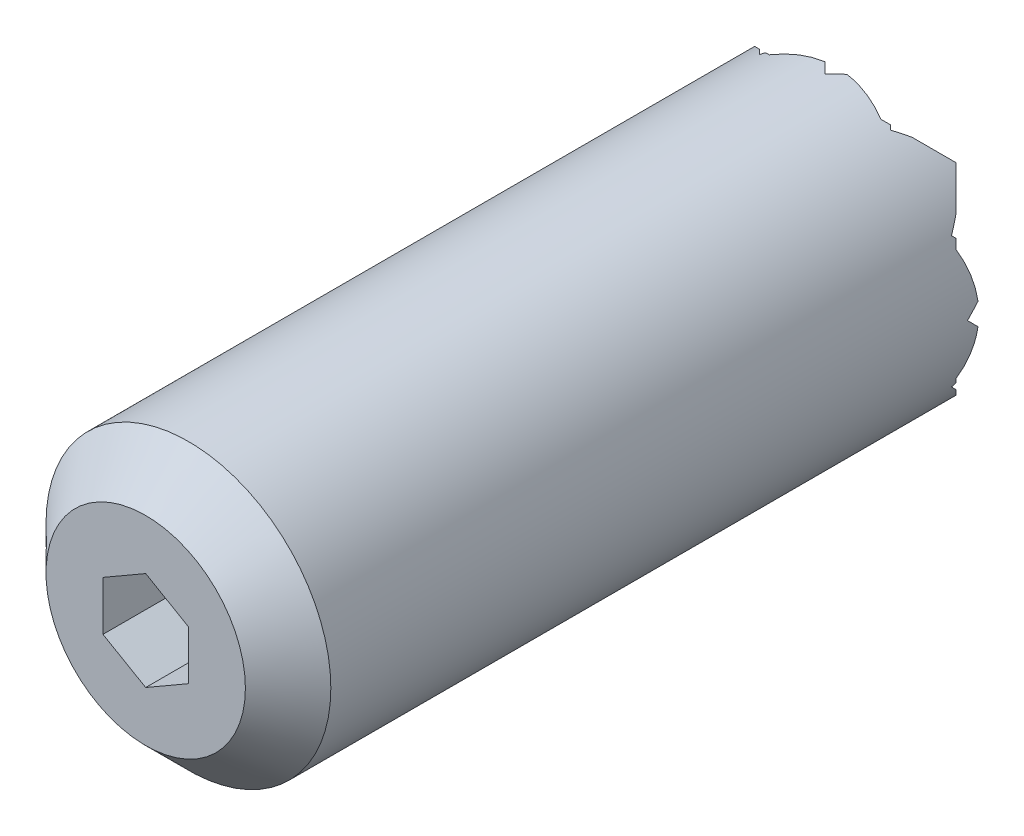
ISO-10303-21;
HEADER;
FILE_DESCRIPTION(('STEP AP214'),'2;1');
FILE_NAME('part.step','',(''),(''),'','','');
FILE_SCHEMA(('AUTOMOTIVE_DESIGN { 1 0 10303 214 1 1 1 1 }'));
ENDSEC;
DATA;
#1=APPLICATION_CONTEXT('core data for automotive mechanical design processes');
#2=APPLICATION_PROTOCOL_DEFINITION('international standard','automotive_design',2000,#1);
#3=PRODUCT_CONTEXT('',#1,'mechanical');
#4=PRODUCT('Part','Part','',(#3));
#5=PRODUCT_RELATED_PRODUCT_CATEGORY('part','',(#4));
#6=PRODUCT_DEFINITION_FORMATION('','',#4);
#7=PRODUCT_DEFINITION_CONTEXT('part definition',#1,'design');
#8=PRODUCT_DEFINITION('design','',#6,#7);
#9=PRODUCT_DEFINITION_SHAPE('','',#8);
#10=(LENGTH_UNIT() NAMED_UNIT(*) SI_UNIT(.MILLI.,.METRE.));
#11=(NAMED_UNIT(*) PLANE_ANGLE_UNIT() SI_UNIT($,.RADIAN.));
#12=(NAMED_UNIT(*) SI_UNIT($,.STERADIAN.) SOLID_ANGLE_UNIT());
#13=UNCERTAINTY_MEASURE_WITH_UNIT(LENGTH_MEASURE(1.E-05),#10,'distance_accuracy_value','');
#14=(GEOMETRIC_REPRESENTATION_CONTEXT(3) GLOBAL_UNCERTAINTY_ASSIGNED_CONTEXT((#13)) GLOBAL_UNIT_ASSIGNED_CONTEXT((#10,
#11,#12)) REPRESENTATION_CONTEXT('',''));
#15=CARTESIAN_POINT('',(0.,0.,0.));
#16=DIRECTION('',(0.,0.,1.));
#17=DIRECTION('',(1.,0.,0.));
#18=AXIS2_PLACEMENT_3D('',#15,#16,#17);
#19=CARTESIAN_POINT('',(0.,-10.,1.15));
#20=DIRECTION('',(-0.707106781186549,0.,0.707106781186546));
#21=DIRECTION('',(0.707106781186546,0.,0.707106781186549));
#22=AXIS2_PLACEMENT_3D('',#19,#20,#21);
#23=PLANE('',#22);
#24=CARTESIAN_POINT('',(0.,0.,1.15));
#25=DIRECTION('',(-0.707106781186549,0.,0.707106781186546));
#26=DIRECTION('',(0.707106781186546,0.,0.707106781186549));
#27=AXIS2_PLACEMENT_3D('',#24,#25,#26);
#28=ELLIPSE('',#27,7.07106781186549,5.);
#29=CARTESIAN_POINT('',(0.,-5.,1.15));
#30=VERTEX_POINT('',#29);
#31=CARTESIAN_POINT('',(-0.385144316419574,-4.98514431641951,0.7648556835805));
#32=VERTEX_POINT('',#31);
#33=EDGE_CURVE('E452',#30,#32,#28,.F.);
#34=ORIENTED_EDGE('',*,*,#33,.T.);
#35=DIRECTION('',(0.577350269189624,0.577350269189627,0.577350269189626));
#36=VECTOR('',#35,1.);
#37=CARTESIAN_POINT('',(-1.80000000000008,-6.4,-0.65));
#38=LINE('',#37,#36);
#39=CARTESIAN_POINT('',(0.,-4.6,1.15));
#40=VERTEX_POINT('',#39);
#41=EDGE_CURVE('E949',#32,#40,#38,.T.);
#42=ORIENTED_EDGE('',*,*,#41,.T.);
#43=DIRECTION('',(0.,1.,0.));
#44=VECTOR('',#43,1.);
#45=CARTESIAN_POINT('',(0.,-10.,1.15));
#46=LINE('',#45,#44);
#47=EDGE_CURVE('E352',#30,#40,#46,.T.);
#48=ORIENTED_EDGE('',*,*,#47,.F.);
#49=EDGE_LOOP('',(#34,#42,#48));
#50=FACE_BOUND('',#49,.T.);
#51=ADVANCED_FACE('F14',(#50),#23,.F.);
#52=CARTESIAN_POINT('',(0.,4.6,1.15));
#53=VERTEX_POINT('',#52);
#54=CARTESIAN_POINT('',(0.,5.,1.15));
#55=VERTEX_POINT('',#54);
#56=EDGE_CURVE('E343',#53,#55,#46,.T.);
#57=ORIENTED_EDGE('',*,*,#56,.F.);
#58=DIRECTION('',(-0.577350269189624,0.577350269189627,-0.577350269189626));
#59=VECTOR('',#58,1.);
#60=CARTESIAN_POINT('',(4.86666666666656,-0.266666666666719,6.0166666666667));
#61=LINE('',#60,#59);
#62=CARTESIAN_POINT('',(-0.385144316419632,4.9851443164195,0.764855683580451));
#63=VERTEX_POINT('',#62);
#64=EDGE_CURVE('E715',#53,#63,#61,.T.);
#65=ORIENTED_EDGE('',*,*,#64,.T.);
#66=EDGE_CURVE('E455',#63,#55,#28,.F.);
#67=ORIENTED_EDGE('',*,*,#66,.T.);
#68=EDGE_LOOP('',(#57,#65,#67));
#69=FACE_BOUND('',#68,.T.);
#70=ADVANCED_FACE('F826',(#69),#23,.F.);
#71=CARTESIAN_POINT('',(-1.1500000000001,-10.,0.));
#72=DIRECTION('',(0.707106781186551,0.,0.707106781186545));
#73=DIRECTION('',(0.707106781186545,0.,-0.707106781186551));
#74=AXIS2_PLACEMENT_3D('',#71,#72,#73);
#75=PLANE('',#74);
#76=DIRECTION('',(0.577350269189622,-0.577350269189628,-0.577350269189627));
#77=VECTOR('',#76,1.);
#78=CARTESIAN_POINT('',(1.03333333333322,-5.63333333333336,-2.18333333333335));
#79=LINE('',#78,#77);
#80=CARTESIAN_POINT('',(-2.3000000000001,-2.3,1.15));
#81=VERTEX_POINT('',#80);
#82=CARTESIAN_POINT('',(-1.15000000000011,-3.45,0.));
#83=VERTEX_POINT('',#82);
#84=EDGE_CURVE('E561',#81,#83,#79,.T.);
#85=ORIENTED_EDGE('',*,*,#84,.T.);
#86=DIRECTION('',(-0.577350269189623,-0.577350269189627,0.577350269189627));
#87=VECTOR('',#86,1.);
#88=CARTESIAN_POINT('',(-3.33333333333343,-5.63333333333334,2.18333333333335));
#89=LINE('',#88,#87);
#90=CARTESIAN_POINT('',(-2.19327683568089,-4.49327683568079,1.0432768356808));
#91=VERTEX_POINT('',#90);
#92=EDGE_CURVE('E535',#83,#91,#89,.T.);
#93=ORIENTED_EDGE('',*,*,#92,.T.);
#94=CARTESIAN_POINT('',(0.,0.,-1.15));
#95=DIRECTION('',(0.707106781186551,0.,0.707106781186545));
#96=DIRECTION('',(-0.707106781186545,0.,0.707106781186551));
#97=AXIS2_PLACEMENT_3D('',#94,#95,#96);
#98=ELLIPSE('',#97,7.07106781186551,5.);
#99=CARTESIAN_POINT('',(-2.3000000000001,-4.43959457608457,1.15));
#100=VERTEX_POINT('',#99);
#101=EDGE_CURVE('E456',#91,#100,#98,.F.);
#102=ORIENTED_EDGE('',*,*,#101,.T.);
#103=DIRECTION('',(0.,1.,0.));
#104=VECTOR('',#103,1.);
#105=CARTESIAN_POINT('',(-2.3000000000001,-10.,1.15));
#106=LINE('',#105,#104);
#107=EDGE_CURVE('E361',#100,#81,#106,.T.);
#108=ORIENTED_EDGE('',*,*,#107,.T.);
#109=EDGE_LOOP('',(#85,#93,#102,#108));
#110=FACE_BOUND('',#109,.T.);
#111=ADVANCED_FACE('F875',(#110),#75,.F.);
#112=CARTESIAN_POINT('',(-2.3000000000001,-10.,1.15));
#113=DIRECTION('',(-0.707106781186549,0.,0.707106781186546));
#114=DIRECTION('',(0.707106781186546,0.,0.707106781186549));
#115=AXIS2_PLACEMENT_3D('',#112,#113,#114);
#116=PLANE('',#115);
#117=CARTESIAN_POINT('',(0.,0.,3.45));
#118=DIRECTION('',(-0.707106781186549,0.,0.707106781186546));
#119=DIRECTION('',(0.707106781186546,0.,0.707106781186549));
#120=AXIS2_PLACEMENT_3D('',#117,#118,#119);
#121=ELLIPSE('',#120,7.07106781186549,5.);
#122=CARTESIAN_POINT('',(-2.67701875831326,-4.22298124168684,0.772981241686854));
#123=VERTEX_POINT('',#122);
#124=EDGE_CURVE('E460',#100,#123,#121,.F.);
#125=ORIENTED_EDGE('',*,*,#124,.T.);
#126=DIRECTION('',(-0.577350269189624,0.577350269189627,-0.577350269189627));
#127=VECTOR('',#126,1.);
#128=CARTESIAN_POINT('',(-0.500000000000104,-6.4,2.95));
#129=LINE('',#128,#127);
#130=CARTESIAN_POINT('',(-3.45000000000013,-3.45,0.));
#131=VERTEX_POINT('',#130);
#132=EDGE_CURVE('E549',#123,#131,#129,.T.);
#133=ORIENTED_EDGE('',*,*,#132,.T.);
#134=DIRECTION('',(0.577350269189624,0.577350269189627,0.577350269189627));
#135=VECTOR('',#134,1.);
#136=CARTESIAN_POINT('',(-4.86666666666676,-4.86666666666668,-1.41666666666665));
#137=LINE('',#136,#135);
#138=EDGE_CURVE('E565',#131,#81,#137,.T.);
#139=ORIENTED_EDGE('',*,*,#138,.T.);
#140=ORIENTED_EDGE('',*,*,#107,.F.);
#141=EDGE_LOOP('',(#125,#133,#139,#140));
#142=FACE_BOUND('',#141,.T.);
#143=ADVANCED_FACE('F930',(#142),#116,.F.);
#144=CARTESIAN_POINT('',(-3.45000000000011,-10.,0.));
#145=DIRECTION('',(0.707106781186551,0.,0.707106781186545));
#146=DIRECTION('',(0.707106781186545,0.,-0.707106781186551));
#147=AXIS2_PLACEMENT_3D('',#144,#145,#146);
#148=PLANE('',#147);
#149=CARTESIAN_POINT('',(0.,0.,-3.45));
#150=DIRECTION('',(0.707106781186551,0.,0.707106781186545));
#151=DIRECTION('',(-0.707106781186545,0.,0.707106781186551));
#152=AXIS2_PLACEMENT_3D('',#149,#150,#151);
#153=ELLIPSE('',#152,7.07106781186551,5.);
#154=CARTESIAN_POINT('',(-4.60000000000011,1.95959179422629,1.15));
#155=VERTEX_POINT('',#154);
#156=CARTESIAN_POINT('',(-4.49327683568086,2.19327683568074,1.04327683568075));
#157=VERTEX_POINT('',#156);
#158=EDGE_CURVE('E467',#155,#157,#153,.F.);
#159=ORIENTED_EDGE('',*,*,#158,.T.);
#160=DIRECTION('',(0.577350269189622,-0.577350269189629,-0.577350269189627));
#161=VECTOR('',#160,1.);
#162=CARTESIAN_POINT('',(0.266666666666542,-2.56666666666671,-3.7166666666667));
#163=LINE('',#162,#161);
#164=CARTESIAN_POINT('',(-3.45000000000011,1.15,0.));
#165=VERTEX_POINT('',#164);
#166=EDGE_CURVE('E344',#157,#165,#163,.T.);
#167=ORIENTED_EDGE('',*,*,#166,.T.);
#168=DIRECTION('',(-0.577350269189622,-0.577350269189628,0.577350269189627));
#169=VECTOR('',#168,1.);
#170=CARTESIAN_POINT('',(-7.16666666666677,-2.56666666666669,3.7166666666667));
#171=LINE('',#170,#169);
#172=CARTESIAN_POINT('',(-4.60000000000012,0.,1.15));
#173=VERTEX_POINT('',#172);
#174=EDGE_CURVE('E646',#165,#173,#171,.T.);
#175=ORIENTED_EDGE('',*,*,#174,.T.);
#176=DIRECTION('',(0.,1.,0.));
#177=VECTOR('',#176,1.);
#178=CARTESIAN_POINT('',(-4.60000000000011,-10.,1.15));
#179=LINE('',#178,#177);
#180=EDGE_CURVE('E370',#173,#155,#179,.T.);
#181=ORIENTED_EDGE('',*,*,#180,.T.);
#182=EDGE_LOOP('',(#159,#167,#175,#181));
#183=FACE_BOUND('',#182,.T.);
#184=ADVANCED_FACE('F841',(#183),#148,.F.);
#185=CARTESIAN_POINT('',(-4.60000000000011,-1.95959179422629,1.15));
#186=VERTEX_POINT('',#185);
#187=EDGE_CURVE('E367',#186,#173,#179,.T.);
#188=ORIENTED_EDGE('',*,*,#187,.T.);
#189=DIRECTION('',(0.577350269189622,-0.577350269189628,-0.577350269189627));
#190=VECTOR('',#189,1.);
#191=CARTESIAN_POINT('',(-0.500000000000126,-4.1,-2.95));
#192=LINE('',#191,#190);
#193=CARTESIAN_POINT('',(-3.45000000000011,-1.15,0.));
#194=VERTEX_POINT('',#193);
#195=EDGE_CURVE('E617',#173,#194,#192,.T.);
#196=ORIENTED_EDGE('',*,*,#195,.T.);
#197=DIRECTION('',(-0.577350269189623,-0.577350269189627,0.577350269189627));
#198=VECTOR('',#197,1.);
#199=CARTESIAN_POINT('',(-6.40000000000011,-4.1,2.95));
#200=LINE('',#199,#198);
#201=CARTESIAN_POINT('',(-4.49327683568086,-2.19327683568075,1.04327683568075));
#202=VERTEX_POINT('',#201);
#203=EDGE_CURVE('E590',#194,#202,#200,.T.);
#204=ORIENTED_EDGE('',*,*,#203,.T.);
#205=EDGE_CURVE('E464',#202,#186,#153,.F.);
#206=ORIENTED_EDGE('',*,*,#205,.T.);
#207=EDGE_LOOP('',(#188,#196,#204,#206));
#208=FACE_BOUND('',#207,.T.);
#209=ADVANCED_FACE('F1289',(#208),#148,.F.);
#210=CARTESIAN_POINT('',(-3.5355339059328,-3.53553390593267,0.0855339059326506));
#211=VERTEX_POINT('',#210);
#212=CARTESIAN_POINT('',(-4.22298124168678,-2.67701875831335,0.772981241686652));
#213=VERTEX_POINT('',#212);
#214=EDGE_CURVE('E466',#211,#213,#153,.F.);
#215=ORIENTED_EDGE('',*,*,#214,.T.);
#216=DIRECTION('',(0.577350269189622,-0.577350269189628,-0.577350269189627));
#217=VECTOR('',#216,1.);
#218=CARTESIAN_POINT('',(-1.26666666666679,-5.63333333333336,-2.18333333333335));
#219=LINE('',#218,#217);
#220=EDGE_CURVE('E568',#213,#131,#219,.T.);
#221=ORIENTED_EDGE('',*,*,#220,.T.);
#222=DIRECTION('',(-0.577350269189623,-0.577350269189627,0.577350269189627));
#223=VECTOR('',#222,1.);
#224=CARTESIAN_POINT('',(-5.63333333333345,-5.63333333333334,2.18333333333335));
#225=LINE('',#224,#223);
#226=EDGE_CURVE('E546',#131,#211,#225,.T.);
#227=ORIENTED_EDGE('',*,*,#226,.T.);
#228=EDGE_LOOP('',(#215,#221,#227));
#229=FACE_BOUND('',#228,.T.);
#230=ADVANCED_FACE('F1283',(#229),#148,.F.);
#231=CARTESIAN_POINT('',(-4.60000000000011,-10.,1.15));
#232=DIRECTION('',(-0.707106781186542,0.,0.707106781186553));
#233=DIRECTION('',(0.707106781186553,0.,0.707106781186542));
#234=AXIS2_PLACEMENT_3D('',#231,#232,#233);
#235=PLANE('',#234);
#236=ORIENTED_EDGE('',*,*,#180,.F.);
#237=DIRECTION('',(-0.577350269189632,0.577350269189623,-0.577350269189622));
#238=VECTOR('',#237,1.);
#239=CARTESIAN_POINT('',(-1.26666666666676,-3.33333333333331,4.4833333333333));
#240=LINE('',#239,#238);
#241=CARTESIAN_POINT('',(-4.98514431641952,0.385144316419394,0.7648556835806));
#242=VERTEX_POINT('',#241);
#243=EDGE_CURVE('E648',#173,#242,#240,.T.);
#244=ORIENTED_EDGE('',*,*,#243,.T.);
#245=CARTESIAN_POINT('',(0.,0.,5.75));
#246=DIRECTION('',(-0.707106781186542,0.,0.707106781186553));
#247=DIRECTION('',(0.707106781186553,0.,0.707106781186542));
#248=AXIS2_PLACEMENT_3D('',#245,#246,#247);
#249=ELLIPSE('',#248,7.07106781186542,5.);
#250=EDGE_CURVE('E472',#242,#155,#249,.F.);
#251=ORIENTED_EDGE('',*,*,#250,.T.);
#252=EDGE_LOOP('',(#236,#244,#251));
#253=FACE_BOUND('',#252,.T.);
#254=ADVANCED_FACE('F1328',(#253),#235,.F.);
#255=CARTESIAN_POINT('',(5.7499999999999,-10.,0.));
#256=DIRECTION('',(0.70710678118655,0.,0.707106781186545));
#257=DIRECTION('',(0.707106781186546,0.,-0.70710678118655));
#258=AXIS2_PLACEMENT_3D('',#255,#256,#257);
#259=PLANE('',#258);
#260=CARTESIAN_POINT('',(0.,0.,5.75));
#261=DIRECTION('',(0.70710678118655,0.,0.707106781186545));
#262=DIRECTION('',(-0.707106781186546,0.,0.70710678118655));
#263=AXIS2_PLACEMENT_3D('',#260,#261,#262);
#264=ELLIPSE('',#263,7.0710678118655,5.);
#265=CARTESIAN_POINT('',(4.5999999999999,1.95959179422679,1.15));
#266=VERTEX_POINT('',#265);
#267=CARTESIAN_POINT('',(4.9851443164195,0.38514431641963,0.76485568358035));
#268=VERTEX_POINT('',#267);
#269=EDGE_CURVE('E449',#266,#268,#264,.F.);
#270=ORIENTED_EDGE('',*,*,#269,.T.);
#271=DIRECTION('',(-0.577350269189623,-0.577350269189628,0.577350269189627));
#272=VECTOR('',#271,1.);
#273=CARTESIAN_POINT('',(2.03333333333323,-2.56666666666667,3.71666666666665));
#274=LINE('',#273,#272);
#275=CARTESIAN_POINT('',(4.59999999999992,0.,1.15));
#276=VERTEX_POINT('',#275);
#277=EDGE_CURVE('E631',#268,#276,#274,.T.);
#278=ORIENTED_EDGE('',*,*,#277,.T.);
#279=DIRECTION('',(0.,1.,0.));
#280=VECTOR('',#279,1.);
#281=CARTESIAN_POINT('',(4.5999999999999,-10.,1.15));
#282=LINE('',#281,#280);
#283=EDGE_CURVE('E374',#276,#266,#282,.T.);
#284=ORIENTED_EDGE('',*,*,#283,.T.);
#285=EDGE_LOOP('',(#270,#278,#284));
#286=FACE_BOUND('',#285,.T.);
#287=ADVANCED_FACE('F1335',(#286),#259,.F.);
#288=CARTESIAN_POINT('',(4.5999999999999,-10.,1.15));
#289=DIRECTION('',(-0.707106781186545,0.,0.70710678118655));
#290=DIRECTION('',(0.70710678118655,0.,0.707106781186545));
#291=AXIS2_PLACEMENT_3D('',#288,#289,#290);
#292=PLANE('',#291);
#293=DIRECTION('',(-0.577350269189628,0.577350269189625,-0.577350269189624));
#294=VECTOR('',#293,1.);
#295=CARTESIAN_POINT('',(7.93333333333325,-3.33333333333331,4.4833333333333));
#296=LINE('',#295,#294);
#297=CARTESIAN_POINT('',(3.44999999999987,1.15,0.));
#298=VERTEX_POINT('',#297);
#299=EDGE_CURVE('E628',#276,#298,#296,.T.);
#300=ORIENTED_EDGE('',*,*,#299,.T.);
#301=DIRECTION('',(0.577350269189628,0.577350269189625,0.577350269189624));
#302=VECTOR('',#301,1.);
#303=CARTESIAN_POINT('',(0.499999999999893,-1.8,-2.95));
#304=LINE('',#303,#302);
#305=CARTESIAN_POINT('',(4.49327683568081,2.19327683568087,1.0432768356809));
#306=VERTEX_POINT('',#305);
#307=EDGE_CURVE('E341',#298,#306,#304,.T.);
#308=ORIENTED_EDGE('',*,*,#307,.T.);
#309=CARTESIAN_POINT('',(0.,0.,-3.45));
#310=DIRECTION('',(-0.707106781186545,0.,0.70710678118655));
#311=DIRECTION('',(0.70710678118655,0.,0.707106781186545));
#312=AXIS2_PLACEMENT_3D('',#309,#310,#311);
#313=ELLIPSE('',#312,7.07106781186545,5.);
#314=EDGE_CURVE('E332',#306,#266,#313,.F.);
#315=ORIENTED_EDGE('',*,*,#314,.T.);
#316=ORIENTED_EDGE('',*,*,#283,.F.);
#317=EDGE_LOOP('',(#300,#308,#315,#316));
#318=FACE_BOUND('',#317,.T.);
#319=ADVANCED_FACE('F656',(#318),#292,.F.);
#320=DIRECTION('',(-0.577350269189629,0.577350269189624,-0.577350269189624));
#321=VECTOR('',#320,1.);
#322=CARTESIAN_POINT('',(7.16666666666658,-4.86666666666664,3.71666666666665));
#323=LINE('',#322,#321);
#324=CARTESIAN_POINT('',(4.4932768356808,-2.19327683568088,1.0432768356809));
#325=VERTEX_POINT('',#324);
#326=CARTESIAN_POINT('',(3.44999999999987,-1.15,0.));
#327=VERTEX_POINT('',#326);
#328=EDGE_CURVE('E577',#325,#327,#323,.T.);
#329=ORIENTED_EDGE('',*,*,#328,.T.);
#330=DIRECTION('',(0.577350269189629,0.577350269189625,0.577350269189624));
#331=VECTOR('',#330,1.);
#332=CARTESIAN_POINT('',(1.26666666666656,-3.33333333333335,-2.18333333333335));
#333=LINE('',#332,#331);
#334=EDGE_CURVE('E599',#327,#276,#333,.T.);
#335=ORIENTED_EDGE('',*,*,#334,.T.);
#336=CARTESIAN_POINT('',(4.5999999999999,-1.95959179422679,1.15));
#337=VERTEX_POINT('',#336);
#338=EDGE_CURVE('E371',#337,#276,#282,.T.);
#339=ORIENTED_EDGE('',*,*,#338,.F.);
#340=EDGE_CURVE('E445',#337,#325,#313,.F.);
#341=ORIENTED_EDGE('',*,*,#340,.T.);
#342=EDGE_LOOP('',(#329,#335,#339,#341));
#343=FACE_BOUND('',#342,.T.);
#344=ADVANCED_FACE('F1047',(#343),#292,.F.);
#345=DIRECTION('',(-0.577350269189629,0.577350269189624,-0.577350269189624));
#346=VECTOR('',#345,1.);
#347=CARTESIAN_POINT('',(6.39999999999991,-6.4,2.95));
#348=LINE('',#347,#346);
#349=CARTESIAN_POINT('',(3.5355339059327,-3.53553390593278,0.0855339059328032));
#350=VERTEX_POINT('',#349);
#351=CARTESIAN_POINT('',(3.44999999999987,-3.45,0.));
#352=VERTEX_POINT('',#351);
#353=EDGE_CURVE('E542',#350,#352,#348,.T.);
#354=ORIENTED_EDGE('',*,*,#353,.T.);
#355=DIRECTION('',(0.577350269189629,0.577350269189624,0.577350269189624));
#356=VECTOR('',#355,1.);
#357=CARTESIAN_POINT('',(2.03333333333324,-4.86666666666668,-1.41666666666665));
#358=LINE('',#357,#356);
#359=CARTESIAN_POINT('',(4.22298124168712,-2.67701875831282,0.772981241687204));
#360=VERTEX_POINT('',#359);
#361=EDGE_CURVE('E554',#352,#360,#358,.T.);
#362=ORIENTED_EDGE('',*,*,#361,.T.);
#363=EDGE_CURVE('E443',#360,#350,#313,.F.);
#364=ORIENTED_EDGE('',*,*,#363,.T.);
#365=EDGE_LOOP('',(#354,#362,#364));
#366=FACE_BOUND('',#365,.T.);
#367=ADVANCED_FACE('F1042',(#366),#292,.F.);
#368=CARTESIAN_POINT('',(3.44999999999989,-10.,0.));
#369=DIRECTION('',(0.70710678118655,0.,0.707106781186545));
#370=DIRECTION('',(0.707106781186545,0.,-0.70710678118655));
#371=AXIS2_PLACEMENT_3D('',#368,#369,#370);
#372=PLANE('',#371);
#373=DIRECTION('',(0.577350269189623,-0.577350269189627,-0.577350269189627));
#374=VECTOR('',#373,1.);
#375=CARTESIAN_POINT('',(5.63333333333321,-5.63333333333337,-2.18333333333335));
#376=LINE('',#375,#374);
#377=CARTESIAN_POINT('',(2.29999999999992,-2.3,1.15));
#378=VERTEX_POINT('',#377);
#379=EDGE_CURVE('E519',#378,#352,#376,.T.);
#380=ORIENTED_EDGE('',*,*,#379,.T.);
#381=DIRECTION('',(-0.577350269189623,-0.577350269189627,0.577350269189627));
#382=VECTOR('',#381,1.);
#383=CARTESIAN_POINT('',(1.26666666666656,-5.63333333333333,2.18333333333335));
#384=LINE('',#383,#382);
#385=CARTESIAN_POINT('',(2.67701875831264,-4.22298124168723,0.772981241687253));
#386=VERTEX_POINT('',#385);
#387=EDGE_CURVE('E539',#352,#386,#384,.T.);
#388=ORIENTED_EDGE('',*,*,#387,.T.);
#389=CARTESIAN_POINT('',(0.,0.,3.45));
#390=DIRECTION('',(0.70710678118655,0.,0.707106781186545));
#391=DIRECTION('',(-0.707106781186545,0.,0.70710678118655));
#392=AXIS2_PLACEMENT_3D('',#389,#390,#391);
#393=ELLIPSE('',#392,7.0710678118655,5.);
#394=CARTESIAN_POINT('',(2.2999999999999,-4.43959457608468,1.15));
#395=VERTEX_POINT('',#394);
#396=EDGE_CURVE('E440',#386,#395,#393,.F.);
#397=ORIENTED_EDGE('',*,*,#396,.T.);
#398=DIRECTION('',(0.,1.,0.));
#399=VECTOR('',#398,1.);
#400=CARTESIAN_POINT('',(2.2999999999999,-10.,1.15));
#401=LINE('',#400,#399);
#402=EDGE_CURVE('E375',#395,#378,#401,.T.);
#403=ORIENTED_EDGE('',*,*,#402,.T.);
#404=EDGE_LOOP('',(#380,#388,#397,#403));
#405=FACE_BOUND('',#404,.T.);
#406=ADVANCED_FACE('F1031',(#405),#372,.F.);
#407=CARTESIAN_POINT('',(2.2999999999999,-10.,1.15));
#408=DIRECTION('',(-0.707106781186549,0.,0.707106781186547));
#409=DIRECTION('',(0.707106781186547,0.,0.707106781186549));
#410=AXIS2_PLACEMENT_3D('',#407,#408,#409);
#411=PLANE('',#410);
#412=CARTESIAN_POINT('',(0.,0.,-1.15));
#413=DIRECTION('',(-0.707106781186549,0.,0.707106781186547));
#414=DIRECTION('',(0.707106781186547,0.,0.707106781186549));
#415=AXIS2_PLACEMENT_3D('',#412,#413,#414);
#416=ELLIPSE('',#415,7.07106781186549,5.);
#417=CARTESIAN_POINT('',(2.19327683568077,-4.49327683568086,1.04327683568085));
#418=VERTEX_POINT('',#417);
#419=EDGE_CURVE('E436',#395,#418,#416,.F.);
#420=ORIENTED_EDGE('',*,*,#419,.T.);
#421=DIRECTION('',(-0.577350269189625,0.577350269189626,-0.577350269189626));
#422=VECTOR('',#421,1.);
#423=CARTESIAN_POINT('',(4.09999999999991,-6.4,2.95));
#424=LINE('',#423,#422);
#425=CARTESIAN_POINT('',(1.1499999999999,-3.45,0.));
#426=VERTEX_POINT('',#425);
#427=EDGE_CURVE('E505',#418,#426,#424,.T.);
#428=ORIENTED_EDGE('',*,*,#427,.T.);
#429=DIRECTION('',(0.577350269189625,0.577350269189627,0.577350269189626));
#430=VECTOR('',#429,1.);
#431=CARTESIAN_POINT('',(-0.266666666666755,-4.86666666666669,-1.4166666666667));
#432=LINE('',#431,#430);
#433=EDGE_CURVE('E512',#426,#378,#432,.T.);
#434=ORIENTED_EDGE('',*,*,#433,.T.);
#435=ORIENTED_EDGE('',*,*,#402,.F.);
#436=EDGE_LOOP('',(#420,#428,#434,#435));
#437=FACE_BOUND('',#436,.T.);
#438=ADVANCED_FACE('F522',(#437),#411,.F.);
#439=CARTESIAN_POINT('',(1.14999999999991,-10.,0.));
#440=DIRECTION('',(0.707106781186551,0.,0.707106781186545));
#441=DIRECTION('',(0.707106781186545,0.,-0.707106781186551));
#442=AXIS2_PLACEMENT_3D('',#439,#440,#441);
#443=PLANE('',#442);
#444=ORIENTED_EDGE('',*,*,#47,.T.);
#445=DIRECTION('',(0.577350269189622,-0.577350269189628,-0.577350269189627));
#446=VECTOR('',#445,1.);
#447=CARTESIAN_POINT('',(2.56666666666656,-7.1666666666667,-1.41666666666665));
#448=LINE('',#447,#446);
#449=CARTESIAN_POINT('',(0.385144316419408,-4.98514431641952,0.7648556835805));
#450=VERTEX_POINT('',#449);
#451=EDGE_CURVE('E9',#40,#450,#448,.T.);
#452=ORIENTED_EDGE('',*,*,#451,.T.);
#453=CARTESIAN_POINT('',(0.,0.,1.15));
#454=DIRECTION('',(0.707106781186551,0.,0.707106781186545));
#455=DIRECTION('',(-0.707106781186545,0.,0.707106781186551));
#456=AXIS2_PLACEMENT_3D('',#453,#454,#455);
#457=ELLIPSE('',#456,7.07106781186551,5.);
#458=EDGE_CURVE('E434',#450,#30,#457,.F.);
#459=ORIENTED_EDGE('',*,*,#458,.T.);
#460=EDGE_LOOP('',(#444,#452,#459));
#461=FACE_BOUND('',#460,.T.);
#462=ADVANCED_FACE('F889',(#461),#443,.F.);
#463=CARTESIAN_POINT('',(0.385144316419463,4.98514431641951,0.764855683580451));
#464=VERTEX_POINT('',#463);
#465=EDGE_CURVE('E437',#55,#464,#457,.F.);
#466=ORIENTED_EDGE('',*,*,#465,.T.);
#467=DIRECTION('',(-0.577350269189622,-0.577350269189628,0.577350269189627));
#468=VECTOR('',#467,1.);
#469=CARTESIAN_POINT('',(-4.10000000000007,0.499999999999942,5.25));
#470=LINE('',#469,#468);
#471=EDGE_CURVE('E479',#464,#53,#470,.T.);
#472=ORIENTED_EDGE('',*,*,#471,.T.);
#473=ORIENTED_EDGE('',*,*,#56,.T.);
#474=EDGE_LOOP('',(#466,#472,#473));
#475=FACE_BOUND('',#474,.T.);
#476=ADVANCED_FACE('F831',(#475),#443,.F.);
#477=CARTESIAN_POINT('',(0.,0.,45.));
#478=DIRECTION('',(0.,0.,1.));
#479=DIRECTION('',(1.,0.,0.));
#480=AXIS2_PLACEMENT_3D('',#477,#478,#479);
#481=CYLINDRICAL_SURFACE('',#480,5.);
#482=CARTESIAN_POINT('',(0.,0.,1.15));
#483=DIRECTION('',(0.,0.707106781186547,0.707106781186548));
#484=DIRECTION('',(0.,-0.707106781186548,0.707106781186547));
#485=AXIS2_PLACEMENT_3D('',#482,#483,#484);
#486=ELLIPSE('',#485,7.07106781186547,5.);
#487=CARTESIAN_POINT('',(5.,0.,1.15));
#488=VERTEX_POINT('',#487);
#489=EDGE_CURVE('E637',#268,#488,#486,.F.);
#490=ORIENTED_EDGE('',*,*,#489,.F.);
#491=ORIENTED_EDGE('',*,*,#269,.F.);
#492=ORIENTED_EDGE('',*,*,#314,.F.);
#493=CARTESIAN_POINT('',(0.,0.,-1.15));
#494=DIRECTION('',(0.,-0.707106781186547,0.707106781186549));
#495=DIRECTION('',(0.,0.707106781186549,0.707106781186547));
#496=AXIS2_PLACEMENT_3D('',#493,#494,#495);
#497=ELLIPSE('',#496,7.07106781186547,5.);
#498=CARTESIAN_POINT('',(4.43959457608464,2.3,1.15));
#499=VERTEX_POINT('',#498);
#500=EDGE_CURVE('E317',#499,#306,#497,.F.);
#501=ORIENTED_EDGE('',*,*,#500,.F.);
#502=CARTESIAN_POINT('',(0.,0.,3.45));
#503=DIRECTION('',(0.,0.707106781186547,0.707106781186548));
#504=DIRECTION('',(0.,-0.707106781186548,0.707106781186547));
#505=AXIS2_PLACEMENT_3D('',#502,#503,#504);
#506=ELLIPSE('',#505,7.07106781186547,5.);
#507=CARTESIAN_POINT('',(4.22298124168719,2.6770187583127,0.772981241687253));
#508=VERTEX_POINT('',#507);
#509=EDGE_CURVE('E299',#508,#499,#506,.F.);
#510=ORIENTED_EDGE('',*,*,#509,.F.);
#511=CARTESIAN_POINT('',(3.5355339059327,3.53553390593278,0.0855339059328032));
#512=VERTEX_POINT('',#511);
#513=EDGE_CURVE('E458',#512,#508,#313,.F.);
#514=ORIENTED_EDGE('',*,*,#513,.F.);
#515=CARTESIAN_POINT('',(0.,0.,-3.45));
#516=DIRECTION('',(0.,-0.707106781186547,0.707106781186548));
#517=DIRECTION('',(0.,0.707106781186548,0.707106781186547));
#518=AXIS2_PLACEMENT_3D('',#515,#516,#517);
#519=ELLIPSE('',#518,7.07106781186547,5.);
#520=CARTESIAN_POINT('',(2.67701875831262,4.22298124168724,0.772981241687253));
#521=VERTEX_POINT('',#520);
#522=EDGE_CURVE('E699',#521,#512,#519,.F.);
#523=ORIENTED_EDGE('',*,*,#522,.F.);
#524=CARTESIAN_POINT('',(2.2999999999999,4.43959457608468,1.15));
#525=VERTEX_POINT('',#524);
#526=EDGE_CURVE('E444',#525,#521,#393,.F.);
#527=ORIENTED_EDGE('',*,*,#526,.F.);
#528=CARTESIAN_POINT('',(2.19327683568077,4.49327683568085,1.04327683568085));
#529=VERTEX_POINT('',#528);
#530=EDGE_CURVE('E441',#529,#525,#416,.F.);
#531=ORIENTED_EDGE('',*,*,#530,.F.);
#532=CARTESIAN_POINT('',(1.95959179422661,4.6,1.15));
#533=VERTEX_POINT('',#532);
#534=EDGE_CURVE('E711',#533,#529,#519,.F.);
#535=ORIENTED_EDGE('',*,*,#534,.F.);
#536=CARTESIAN_POINT('',(0.,0.,5.75));
#537=DIRECTION('',(0.,0.707106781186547,0.707106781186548));
#538=DIRECTION('',(0.,-0.707106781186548,0.707106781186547));
#539=AXIS2_PLACEMENT_3D('',#536,#537,#538);
#540=ELLIPSE('',#539,7.07106781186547,5.);
#541=EDGE_CURVE('E720',#464,#533,#540,.F.);
#542=ORIENTED_EDGE('',*,*,#541,.F.);
#543=ORIENTED_EDGE('',*,*,#465,.F.);
#544=ORIENTED_EDGE('',*,*,#66,.F.);
#545=CARTESIAN_POINT('',(-1.95959179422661,4.6,1.15));
#546=VERTEX_POINT('',#545);
#547=EDGE_CURVE('E999',#546,#63,#540,.F.);
#548=ORIENTED_EDGE('',*,*,#547,.F.);
#549=CARTESIAN_POINT('',(-2.19327683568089,4.49327683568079,1.0432768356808));
#550=VERTEX_POINT('',#549);
#551=EDGE_CURVE('E705',#550,#546,#519,.F.);
#552=ORIENTED_EDGE('',*,*,#551,.F.);
#553=CARTESIAN_POINT('',(-2.3000000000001,4.43959457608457,1.15));
#554=VERTEX_POINT('',#553);
#555=EDGE_CURVE('E459',#554,#550,#98,.F.);
#556=ORIENTED_EDGE('',*,*,#555,.F.);
#557=CARTESIAN_POINT('',(-2.67701875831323,4.22298124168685,0.772981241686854));
#558=VERTEX_POINT('',#557);
#559=EDGE_CURVE('E463',#558,#554,#121,.F.);
#560=ORIENTED_EDGE('',*,*,#559,.F.);
#561=CARTESIAN_POINT('',(-3.5355339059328,3.53553390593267,0.0855339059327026));
#562=VERTEX_POINT('',#561);
#563=EDGE_CURVE('E706',#562,#558,#519,.F.);
#564=ORIENTED_EDGE('',*,*,#563,.F.);
#565=CARTESIAN_POINT('',(-4.22298124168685,2.67701875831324,0.772981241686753));
#566=VERTEX_POINT('',#565);
#567=EDGE_CURVE('E471',#566,#562,#153,.F.);
#568=ORIENTED_EDGE('',*,*,#567,.F.);
#569=CARTESIAN_POINT('',(-4.43959457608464,2.3,1.15));
#570=VERTEX_POINT('',#569);
#571=EDGE_CURVE('E313',#570,#566,#506,.F.);
#572=ORIENTED_EDGE('',*,*,#571,.F.);
#573=EDGE_CURVE('E336',#157,#570,#497,.F.);
#574=ORIENTED_EDGE('',*,*,#573,.F.);
#575=ORIENTED_EDGE('',*,*,#158,.F.);
#576=ORIENTED_EDGE('',*,*,#250,.F.);
#577=CARTESIAN_POINT('',(-5.,0.,1.15));
#578=VERTEX_POINT('',#577);
#579=EDGE_CURVE('E640',#578,#242,#486,.F.);
#580=ORIENTED_EDGE('',*,*,#579,.F.);
#581=CARTESIAN_POINT('',(0.,0.,1.15));
#582=DIRECTION('',(0.,-0.707106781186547,0.707106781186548));
#583=DIRECTION('',(0.,0.707106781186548,0.707106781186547));
#584=AXIS2_PLACEMENT_3D('',#581,#582,#583);
#585=ELLIPSE('',#584,7.07106781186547,5.);
#586=CARTESIAN_POINT('',(-4.98514431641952,-0.385144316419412,0.7648556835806));
#587=VERTEX_POINT('',#586);
#588=EDGE_CURVE('E611',#587,#578,#585,.F.);
#589=ORIENTED_EDGE('',*,*,#588,.F.);
#590=EDGE_CURVE('E468',#186,#587,#249,.F.);
#591=ORIENTED_EDGE('',*,*,#590,.F.);
#592=ORIENTED_EDGE('',*,*,#205,.F.);
#593=CARTESIAN_POINT('',(0.,0.,-1.15));
#594=DIRECTION('',(0.,0.707106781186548,0.707106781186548));
#595=DIRECTION('',(0.,-0.707106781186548,0.707106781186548));
#596=AXIS2_PLACEMENT_3D('',#593,#594,#595);
#597=ELLIPSE('',#596,7.07106781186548,5.);
#598=CARTESIAN_POINT('',(-4.43959457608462,-2.3,1.15));
#599=VERTEX_POINT('',#598);
#600=EDGE_CURVE('E585',#599,#202,#597,.F.);
#601=ORIENTED_EDGE('',*,*,#600,.F.);
#602=CARTESIAN_POINT('',(0.,0.,3.45));
#603=DIRECTION('',(0.,-0.707106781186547,0.707106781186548));
#604=DIRECTION('',(0.,0.707106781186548,0.707106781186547));
#605=AXIS2_PLACEMENT_3D('',#602,#603,#604);
#606=ELLIPSE('',#605,7.07106781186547,5.);
#607=EDGE_CURVE('E562',#213,#599,#606,.F.);
#608=ORIENTED_EDGE('',*,*,#607,.F.);
#609=ORIENTED_EDGE('',*,*,#214,.F.);
#610=CARTESIAN_POINT('',(0.,0.,-3.45));
#611=DIRECTION('',(0.,0.707106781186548,0.707106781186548));
#612=DIRECTION('',(0.,-0.707106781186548,0.707106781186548));
#613=AXIS2_PLACEMENT_3D('',#610,#611,#612);
#614=ELLIPSE('',#613,7.07106781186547,5.);
#615=EDGE_CURVE('E520',#123,#211,#614,.F.);
#616=ORIENTED_EDGE('',*,*,#615,.F.);
#617=ORIENTED_EDGE('',*,*,#124,.F.);
#618=ORIENTED_EDGE('',*,*,#101,.F.);
#619=CARTESIAN_POINT('',(-1.95959179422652,-4.6,1.15));
#620=VERTEX_POINT('',#619);
#621=EDGE_CURVE('E536',#620,#91,#614,.F.);
#622=ORIENTED_EDGE('',*,*,#621,.F.);
#623=CARTESIAN_POINT('',(0.,0.,5.75));
#624=DIRECTION('',(0.,-0.707106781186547,0.707106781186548));
#625=DIRECTION('',(0.,0.707106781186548,0.707106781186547));
#626=AXIS2_PLACEMENT_3D('',#623,#624,#625);
#627=ELLIPSE('',#626,7.07106781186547,5.);
#628=EDGE_CURVE('E530',#32,#620,#627,.F.);
#629=ORIENTED_EDGE('',*,*,#628,.F.);
#630=ORIENTED_EDGE('',*,*,#33,.F.);
#631=ORIENTED_EDGE('',*,*,#458,.F.);
#632=CARTESIAN_POINT('',(1.95959179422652,-4.6,1.15));
#633=VERTEX_POINT('',#632);
#634=EDGE_CURVE('E525',#633,#450,#627,.F.);
#635=ORIENTED_EDGE('',*,*,#634,.F.);
#636=EDGE_CURVE('E528',#418,#633,#614,.F.);
#637=ORIENTED_EDGE('',*,*,#636,.F.);
#638=ORIENTED_EDGE('',*,*,#419,.F.);
#639=ORIENTED_EDGE('',*,*,#396,.F.);
#640=EDGE_CURVE('E545',#350,#386,#614,.F.);
#641=ORIENTED_EDGE('',*,*,#640,.F.);
#642=ORIENTED_EDGE('',*,*,#363,.F.);
#643=CARTESIAN_POINT('',(4.43959457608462,-2.3,1.15));
#644=VERTEX_POINT('',#643);
#645=EDGE_CURVE('E559',#644,#360,#606,.F.);
#646=ORIENTED_EDGE('',*,*,#645,.F.);
#647=EDGE_CURVE('E583',#325,#644,#597,.F.);
#648=ORIENTED_EDGE('',*,*,#647,.F.);
#649=ORIENTED_EDGE('',*,*,#340,.F.);
#650=CARTESIAN_POINT('',(4.9851443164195,-0.385144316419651,0.76485568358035));
#651=VERTEX_POINT('',#650);
#652=EDGE_CURVE('E448',#651,#337,#264,.F.);
#653=ORIENTED_EDGE('',*,*,#652,.F.);
#654=EDGE_CURVE('E608',#488,#651,#585,.F.);
#655=ORIENTED_EDGE('',*,*,#654,.F.);
#656=EDGE_LOOP('',(#490,#491,#492,#501,#510,#514,#523,#527,#531,#535,#542,#543,#544,#548,#552,
#556,#560,#564,#568,#572,#574,#575,#576,#580,#589,#591,#592,#601,#608,#609,#616,#617,#618,#622,
#629,#630,#631,#635,#637,#638,#639,#641,#642,#646,#648,#649,#653,#655));
#657=FACE_BOUND('',#656,.T.);
#658=CARTESIAN_POINT('',(0.,0.,23.5));
#659=DIRECTION('',(0.,0.,1.));
#660=DIRECTION('',(1.,0.,0.));
#661=AXIS2_PLACEMENT_3D('',#658,#659,#660);
#662=CIRCLE('',#661,5.);
#663=CARTESIAN_POINT('',(5.,0.,23.5));
#664=VERTEX_POINT('',#663);
#665=EDGE_CURVE('E431',#664,#664,#662,.F.);
#666=ORIENTED_EDGE('',*,*,#665,.T.);
#667=EDGE_LOOP('',(#666));
#668=FACE_BOUND('',#667,.T.);
#669=ADVANCED_FACE('F328',(#657,#668),#481,.T.);
#670=CARTESIAN_POINT('',(0.,0.,25.));
#671=DIRECTION('',(0.,0.,1.));
#672=DIRECTION('',(1.,0.,0.));
#673=AXIS2_PLACEMENT_3D('',#670,#671,#672);
#674=PLANE('',#673);
#675=CARTESIAN_POINT('',(0.,0.,25.));
#676=DIRECTION('',(0.,0.,1.));
#677=DIRECTION('',(1.,0.,0.));
#678=AXIS2_PLACEMENT_3D('',#675,#676,#677);
#679=CIRCLE('',#678,3.5);
#680=CARTESIAN_POINT('',(3.5,0.,25.));
#681=VERTEX_POINT('',#680);
#682=EDGE_CURVE('E428',#681,#681,#679,.T.);
#683=ORIENTED_EDGE('',*,*,#682,.T.);
#684=EDGE_LOOP('',(#683));
#685=FACE_BOUND('',#684,.T.);
#686=DIRECTION('',(0.866025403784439,-0.5,0.));
#687=VECTOR('',#686,1.);
#688=CARTESIAN_POINT('',(-1.5,-0.866025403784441,25.));
#689=LINE('',#688,#687);
#690=CARTESIAN_POINT('',(-1.5,-0.866025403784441,25.));
#691=VERTEX_POINT('',#690);
#692=CARTESIAN_POINT('',(0.,-1.73205080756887,25.));
#693=VERTEX_POINT('',#692);
#694=EDGE_CURVE('E364',#691,#693,#689,.T.);
#695=ORIENTED_EDGE('',*,*,#694,.F.);
#696=DIRECTION('',(0.,-1.,0.));
#697=VECTOR('',#696,1.);
#698=CARTESIAN_POINT('',(-1.5,0.866025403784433,25.));
#699=LINE('',#698,#697);
#700=CARTESIAN_POINT('',(-1.5,0.866025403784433,25.));
#701=VERTEX_POINT('',#700);
#702=EDGE_CURVE('E394',#701,#691,#699,.T.);
#703=ORIENTED_EDGE('',*,*,#702,.F.);
#704=DIRECTION('',(0.866025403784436,0.5,0.));
#705=VECTOR('',#704,1.);
#706=CARTESIAN_POINT('',(-1.5,0.866025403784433,25.));
#707=LINE('',#706,#705);
#708=CARTESIAN_POINT('',(0.,1.73205080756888,25.));
#709=VERTEX_POINT('',#708);
#710=EDGE_CURVE('E391',#701,#709,#707,.T.);
#711=ORIENTED_EDGE('',*,*,#710,.T.);
#712=DIRECTION('',(-0.866025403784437,0.5,0.));
#713=VECTOR('',#712,1.);
#714=CARTESIAN_POINT('',(1.5,0.866025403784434,25.));
#715=LINE('',#714,#713);
#716=CARTESIAN_POINT('',(1.5,0.866025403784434,25.));
#717=VERTEX_POINT('',#716);
#718=EDGE_CURVE('E388',#717,#709,#715,.T.);
#719=ORIENTED_EDGE('',*,*,#718,.F.);
#720=DIRECTION('',(0.,-1.,0.));
#721=VECTOR('',#720,1.);
#722=CARTESIAN_POINT('',(1.5,0.866025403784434,25.));
#723=LINE('',#722,#721);
#724=CARTESIAN_POINT('',(1.5,-0.866025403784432,25.));
#725=VERTEX_POINT('',#724);
#726=EDGE_CURVE('E385',#717,#725,#723,.T.);
#727=ORIENTED_EDGE('',*,*,#726,.T.);
#728=DIRECTION('',(-0.866025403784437,-0.5,0.));
#729=VECTOR('',#728,1.);
#730=CARTESIAN_POINT('',(1.5,-0.866025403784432,25.));
#731=LINE('',#730,#729);
#732=EDGE_CURVE('E382',#725,#693,#731,.T.);
#733=ORIENTED_EDGE('',*,*,#732,.T.);
#734=EDGE_LOOP('',(#695,#703,#711,#719,#727,#733));
#735=FACE_BOUND('',#734,.T.);
#736=ADVANCED_FACE('F1389',(#685,#735),#674,.T.);
#737=CARTESIAN_POINT('',(-1.5,-0.866025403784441,21.));
#738=DIRECTION('',(-0.5,-0.866025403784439,0.));
#739=DIRECTION('',(-0.866025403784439,0.5,0.));
#740=AXIS2_PLACEMENT_3D('',#737,#738,#739);
#741=PLANE('',#740);
#742=DIRECTION('',(0.,0.,1.));
#743=VECTOR('',#742,1.);
#744=CARTESIAN_POINT('',(-1.5,-0.866025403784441,21.));
#745=LINE('',#744,#743);
#746=CARTESIAN_POINT('',(-1.5,-0.866025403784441,21.));
#747=VERTEX_POINT('',#746);
#748=EDGE_CURVE('E426',#747,#691,#745,.T.);
#749=ORIENTED_EDGE('',*,*,#748,.T.);
#750=ORIENTED_EDGE('',*,*,#694,.T.);
#751=DIRECTION('',(0.,0.,1.));
#752=VECTOR('',#751,1.);
#753=CARTESIAN_POINT('',(0.,-1.73205080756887,21.));
#754=LINE('',#753,#752);
#755=CARTESIAN_POINT('',(0.,-1.73205080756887,21.));
#756=VERTEX_POINT('',#755);
#757=EDGE_CURVE('E415',#756,#693,#754,.T.);
#758=ORIENTED_EDGE('',*,*,#757,.F.);
#759=DIRECTION('',(0.866025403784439,-0.5,0.));
#760=VECTOR('',#759,1.);
#761=CARTESIAN_POINT('',(-1.5,-0.866025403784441,21.));
#762=LINE('',#761,#760);
#763=EDGE_CURVE('E397',#747,#756,#762,.T.);
#764=ORIENTED_EDGE('',*,*,#763,.F.);
#765=EDGE_LOOP('',(#749,#750,#758,#764));
#766=FACE_BOUND('',#765,.T.);
#767=ADVANCED_FACE('F1396',(#766),#741,.F.);
#768=CARTESIAN_POINT('',(-1.5,0.866025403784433,21.));
#769=DIRECTION('',(-1.,0.,0.));
#770=DIRECTION('',(0.,1.,0.));
#771=AXIS2_PLACEMENT_3D('',#768,#769,#770);
#772=PLANE('',#771);
#773=DIRECTION('',(0.,0.,1.));
#774=VECTOR('',#773,1.);
#775=CARTESIAN_POINT('',(-1.5,0.866025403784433,21.));
#776=LINE('',#775,#774);
#777=CARTESIAN_POINT('',(-1.5,0.866025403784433,21.));
#778=VERTEX_POINT('',#777);
#779=EDGE_CURVE('E424',#778,#701,#776,.T.);
#780=ORIENTED_EDGE('',*,*,#779,.T.);
#781=ORIENTED_EDGE('',*,*,#702,.T.);
#782=ORIENTED_EDGE('',*,*,#748,.F.);
#783=DIRECTION('',(0.,-1.,0.));
#784=VECTOR('',#783,1.);
#785=CARTESIAN_POINT('',(-1.5,0.866025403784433,21.));
#786=LINE('',#785,#784);
#787=EDGE_CURVE('E412',#778,#747,#786,.T.);
#788=ORIENTED_EDGE('',*,*,#787,.F.);
#789=EDGE_LOOP('',(#780,#781,#782,#788));
#790=FACE_BOUND('',#789,.T.);
#791=ADVANCED_FACE('F1405',(#790),#772,.F.);
#792=CARTESIAN_POINT('',(-1.5,0.866025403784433,21.));
#793=DIRECTION('',(0.5,-0.866025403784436,0.));
#794=DIRECTION('',(-0.866025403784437,-0.5,0.));
#795=AXIS2_PLACEMENT_3D('',#792,#793,#794);
#796=PLANE('',#795);
#797=DIRECTION('',(0.,0.,1.));
#798=VECTOR('',#797,1.);
#799=CARTESIAN_POINT('',(0.,1.73205080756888,21.));
#800=LINE('',#799,#798);
#801=CARTESIAN_POINT('',(0.,1.73205080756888,21.));
#802=VERTEX_POINT('',#801);
#803=EDGE_CURVE('E422',#802,#709,#800,.T.);
#804=ORIENTED_EDGE('',*,*,#803,.T.);
#805=ORIENTED_EDGE('',*,*,#710,.F.);
#806=ORIENTED_EDGE('',*,*,#779,.F.);
#807=DIRECTION('',(0.866025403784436,0.5,0.));
#808=VECTOR('',#807,1.);
#809=CARTESIAN_POINT('',(-1.5,0.866025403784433,21.));
#810=LINE('',#809,#808);
#811=EDGE_CURVE('E409',#778,#802,#810,.T.);
#812=ORIENTED_EDGE('',*,*,#811,.T.);
#813=EDGE_LOOP('',(#804,#805,#806,#812));
#814=FACE_BOUND('',#813,.T.);
#815=ADVANCED_FACE('F1414',(#814),#796,.T.);
#816=CARTESIAN_POINT('',(1.5,0.866025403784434,21.));
#817=DIRECTION('',(0.5,0.866025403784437,0.));
#818=DIRECTION('',(0.866025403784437,-0.5,0.));
#819=AXIS2_PLACEMENT_3D('',#816,#817,#818);
#820=PLANE('',#819);
#821=DIRECTION('',(0.,0.,1.));
#822=VECTOR('',#821,1.);
#823=CARTESIAN_POINT('',(1.5,0.866025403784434,21.));
#824=LINE('',#823,#822);
#825=CARTESIAN_POINT('',(1.5,0.866025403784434,21.));
#826=VERTEX_POINT('',#825);
#827=EDGE_CURVE('E420',#826,#717,#824,.T.);
#828=ORIENTED_EDGE('',*,*,#827,.T.);
#829=ORIENTED_EDGE('',*,*,#718,.T.);
#830=ORIENTED_EDGE('',*,*,#803,.F.);
#831=DIRECTION('',(-0.866025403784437,0.5,0.));
#832=VECTOR('',#831,1.);
#833=CARTESIAN_POINT('',(1.5,0.866025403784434,21.));
#834=LINE('',#833,#832);
#835=EDGE_CURVE('E406',#826,#802,#834,.T.);
#836=ORIENTED_EDGE('',*,*,#835,.F.);
#837=EDGE_LOOP('',(#828,#829,#830,#836));
#838=FACE_BOUND('',#837,.T.);
#839=ADVANCED_FACE('F1423',(#838),#820,.F.);
#840=CARTESIAN_POINT('',(1.5,0.866025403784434,21.));
#841=DIRECTION('',(-1.,0.,0.));
#842=DIRECTION('',(0.,1.,0.));
#843=AXIS2_PLACEMENT_3D('',#840,#841,#842);
#844=PLANE('',#843);
#845=DIRECTION('',(0.,0.,1.));
#846=VECTOR('',#845,1.);
#847=CARTESIAN_POINT('',(1.5,-0.866025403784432,21.));
#848=LINE('',#847,#846);
#849=CARTESIAN_POINT('',(1.5,-0.866025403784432,21.));
#850=VERTEX_POINT('',#849);
#851=EDGE_CURVE('E418',#850,#725,#848,.T.);
#852=ORIENTED_EDGE('',*,*,#851,.T.);
#853=ORIENTED_EDGE('',*,*,#726,.F.);
#854=ORIENTED_EDGE('',*,*,#827,.F.);
#855=DIRECTION('',(0.,-1.,0.));
#856=VECTOR('',#855,1.);
#857=CARTESIAN_POINT('',(1.5,0.866025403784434,21.));
#858=LINE('',#857,#856);
#859=EDGE_CURVE('E403',#826,#850,#858,.T.);
#860=ORIENTED_EDGE('',*,*,#859,.T.);
#861=EDGE_LOOP('',(#852,#853,#854,#860));
#862=FACE_BOUND('',#861,.T.);
#863=ADVANCED_FACE('F1432',(#862),#844,.T.);
#864=CARTESIAN_POINT('',(1.5,-0.866025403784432,21.));
#865=DIRECTION('',(-0.5,0.866025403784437,0.));
#866=DIRECTION('',(0.866025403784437,0.5,0.));
#867=AXIS2_PLACEMENT_3D('',#864,#865,#866);
#868=PLANE('',#867);
#869=DIRECTION('',(-0.866025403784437,-0.5,0.));
#870=VECTOR('',#869,1.);
#871=CARTESIAN_POINT('',(1.5,-0.866025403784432,21.));
#872=LINE('',#871,#870);
#873=EDGE_CURVE('E400',#850,#756,#872,.T.);
#874=ORIENTED_EDGE('',*,*,#873,.T.);
#875=ORIENTED_EDGE('',*,*,#757,.T.);
#876=ORIENTED_EDGE('',*,*,#732,.F.);
#877=ORIENTED_EDGE('',*,*,#851,.F.);
#878=EDGE_LOOP('',(#874,#875,#876,#877));
#879=FACE_BOUND('',#878,.T.);
#880=ADVANCED_FACE('F1441',(#879),#868,.T.);
#881=CARTESIAN_POINT('',(-3.,0.,21.));
#882=DIRECTION('',(0.,0.,1.));
#883=DIRECTION('',(1.,0.,0.));
#884=AXIS2_PLACEMENT_3D('',#881,#882,#883);
#885=PLANE('',#884);
#886=ORIENTED_EDGE('',*,*,#763,.T.);
#887=ORIENTED_EDGE('',*,*,#873,.F.);
#888=ORIENTED_EDGE('',*,*,#859,.F.);
#889=ORIENTED_EDGE('',*,*,#835,.T.);
#890=ORIENTED_EDGE('',*,*,#811,.F.);
#891=ORIENTED_EDGE('',*,*,#787,.T.);
#892=EDGE_LOOP('',(#886,#887,#888,#889,#890,#891));
#893=FACE_BOUND('',#892,.T.);
#894=ADVANCED_FACE('F1444',(#893),#885,.T.);
#895=CARTESIAN_POINT('',(0.,0.,25.));
#896=DIRECTION('',(0.,0.,-1.));
#897=DIRECTION('',(-1.,0.,0.));
#898=AXIS2_PLACEMENT_3D('',#895,#896,#897);
#899=CONICAL_SURFACE('',#898,3.5,0.785398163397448);
#900=ORIENTED_EDGE('',*,*,#665,.F.);
#901=EDGE_LOOP('',(#900));
#902=FACE_BOUND('',#901,.T.);
#903=ORIENTED_EDGE('',*,*,#682,.F.);
#904=EDGE_LOOP('',(#903));
#905=FACE_BOUND('',#904,.T.);
#906=ADVANCED_FACE('F16',(#902,#905),#899,.T.);
#907=ORIENTED_EDGE('',*,*,#555,.T.);
#908=DIRECTION('',(0.577350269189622,-0.577350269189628,-0.577350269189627));
#909=VECTOR('',#908,1.);
#910=CARTESIAN_POINT('',(3.33333333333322,-1.03333333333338,-4.48333333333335));
#911=LINE('',#910,#909);
#912=CARTESIAN_POINT('',(-1.1500000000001,3.45,0.));
#913=VERTEX_POINT('',#912);
#914=EDGE_CURVE('E714',#550,#913,#911,.T.);
#915=ORIENTED_EDGE('',*,*,#914,.T.);
#916=DIRECTION('',(-0.577350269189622,-0.577350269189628,0.577350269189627));
#917=VECTOR('',#916,1.);
#918=CARTESIAN_POINT('',(-5.63333333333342,-1.03333333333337,4.48333333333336));
#919=LINE('',#918,#917);
#920=CARTESIAN_POINT('',(-2.30000000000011,2.3,1.15));
#921=VERTEX_POINT('',#920);
#922=EDGE_CURVE('E37',#913,#921,#919,.T.);
#923=ORIENTED_EDGE('',*,*,#922,.T.);
#924=EDGE_CURVE('E366',#921,#554,#106,.T.);
#925=ORIENTED_EDGE('',*,*,#924,.T.);
#926=EDGE_LOOP('',(#907,#915,#923,#925));
#927=FACE_BOUND('',#926,.T.);
#928=ADVANCED_FACE('F816',(#927),#75,.F.);
#929=DIRECTION('',(-0.577350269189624,0.577350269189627,-0.577350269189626));
#930=VECTOR('',#929,1.);
#931=CARTESIAN_POINT('',(1.79999999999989,-1.80000000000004,5.25));
#932=LINE('',#931,#930);
#933=CARTESIAN_POINT('',(-3.45000000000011,3.45,0.));
#934=VERTEX_POINT('',#933);
#935=EDGE_CURVE('E737',#921,#934,#932,.T.);
#936=ORIENTED_EDGE('',*,*,#935,.T.);
#937=DIRECTION('',(0.577350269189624,0.577350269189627,0.577350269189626));
#938=VECTOR('',#937,1.);
#939=CARTESIAN_POINT('',(-7.16666666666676,-0.266666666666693,-3.7166666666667));
#940=LINE('',#939,#938);
#941=EDGE_CURVE('E708',#934,#558,#940,.T.);
#942=ORIENTED_EDGE('',*,*,#941,.T.);
#943=ORIENTED_EDGE('',*,*,#559,.T.);
#944=ORIENTED_EDGE('',*,*,#924,.F.);
#945=EDGE_LOOP('',(#936,#942,#943,#944));
#946=FACE_BOUND('',#945,.T.);
#947=ADVANCED_FACE('F818',(#946),#116,.F.);
#948=ORIENTED_EDGE('',*,*,#567,.T.);
#949=DIRECTION('',(0.577350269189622,-0.577350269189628,-0.577350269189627));
#950=VECTOR('',#949,1.);
#951=CARTESIAN_POINT('',(1.0333333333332,-1.03333333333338,-4.48333333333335));
#952=LINE('',#951,#950);
#953=EDGE_CURVE('E702',#562,#934,#952,.T.);
#954=ORIENTED_EDGE('',*,*,#953,.T.);
#955=DIRECTION('',(-0.577350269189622,-0.577350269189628,0.577350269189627));
#956=VECTOR('',#955,1.);
#957=CARTESIAN_POINT('',(-7.93333333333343,-1.03333333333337,4.48333333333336));
#958=LINE('',#957,#956);
#959=EDGE_CURVE('E734',#934,#566,#958,.T.);
#960=ORIENTED_EDGE('',*,*,#959,.T.);
#961=EDGE_LOOP('',(#948,#954,#960));
#962=FACE_BOUND('',#961,.T.);
#963=ADVANCED_FACE('F844',(#962),#148,.F.);
#964=ORIENTED_EDGE('',*,*,#590,.T.);
#965=DIRECTION('',(0.577350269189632,0.577350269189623,0.577350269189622));
#966=VECTOR('',#965,1.);
#967=CARTESIAN_POINT('',(-7.93333333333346,-3.33333333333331,-2.1833333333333));
#968=LINE('',#967,#966);
#969=EDGE_CURVE('E619',#587,#173,#968,.T.);
#970=ORIENTED_EDGE('',*,*,#969,.T.);
#971=ORIENTED_EDGE('',*,*,#187,.F.);
#972=EDGE_LOOP('',(#964,#970,#971));
#973=FACE_BOUND('',#972,.T.);
#974=ADVANCED_FACE('F1282',(#973),#235,.F.);
#975=ORIENTED_EDGE('',*,*,#338,.T.);
#976=DIRECTION('',(0.577350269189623,-0.577350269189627,-0.577350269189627));
#977=VECTOR('',#976,1.);
#978=CARTESIAN_POINT('',(8.69999999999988,-4.10000000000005,-2.95));
#979=LINE('',#978,#977);
#980=EDGE_CURVE('E602',#276,#651,#979,.T.);
#981=ORIENTED_EDGE('',*,*,#980,.T.);
#982=ORIENTED_EDGE('',*,*,#652,.T.);
#983=EDGE_LOOP('',(#975,#981,#982));
#984=FACE_BOUND('',#983,.T.);
#985=ADVANCED_FACE('F1346',(#984),#259,.F.);
#986=DIRECTION('',(-0.577350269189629,0.577350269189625,-0.577350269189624));
#987=VECTOR('',#986,1.);
#988=CARTESIAN_POINT('',(8.7,-1.8,5.25));
#989=LINE('',#988,#987);
#990=CARTESIAN_POINT('',(3.44999999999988,3.45,0.));
#991=VERTEX_POINT('',#990);
#992=EDGE_CURVE('E306',#508,#991,#989,.T.);
#993=ORIENTED_EDGE('',*,*,#992,.T.);
#994=DIRECTION('',(0.577350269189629,0.577350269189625,0.577350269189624));
#995=VECTOR('',#994,1.);
#996=CARTESIAN_POINT('',(-0.266666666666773,-0.266666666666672,-3.71666666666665));
#997=LINE('',#996,#995);
#998=EDGE_CURVE('E703',#991,#512,#997,.T.);
#999=ORIENTED_EDGE('',*,*,#998,.T.);
#1000=ORIENTED_EDGE('',*,*,#513,.T.);
#1001=EDGE_LOOP('',(#993,#999,#1000));
#1002=FACE_BOUND('',#1001,.T.);
#1003=ADVANCED_FACE('F996',(#1002),#292,.F.);
#1004=ORIENTED_EDGE('',*,*,#526,.T.);
#1005=DIRECTION('',(0.577350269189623,-0.577350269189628,-0.577350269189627));
#1006=VECTOR('',#1005,1.);
#1007=CARTESIAN_POINT('',(7.93333333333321,-1.03333333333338,-4.48333333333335));
#1008=LINE('',#1007,#1006);
#1009=EDGE_CURVE('E687',#521,#991,#1008,.T.);
#1010=ORIENTED_EDGE('',*,*,#1009,.T.);
#1011=DIRECTION('',(-0.577350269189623,-0.577350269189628,0.577350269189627));
#1012=VECTOR('',#1011,1.);
#1013=CARTESIAN_POINT('',(-1.03333333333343,-1.03333333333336,4.48333333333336));
#1014=LINE('',#1013,#1012);
#1015=CARTESIAN_POINT('',(2.2999999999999,2.3,1.15));
#1016=VERTEX_POINT('',#1015);
#1017=EDGE_CURVE('E682',#991,#1016,#1014,.T.);
#1018=ORIENTED_EDGE('',*,*,#1017,.T.);
#1019=EDGE_CURVE('E378',#1016,#525,#401,.T.);
#1020=ORIENTED_EDGE('',*,*,#1019,.T.);
#1021=EDGE_LOOP('',(#1004,#1010,#1018,#1020));
#1022=FACE_BOUND('',#1021,.T.);
#1023=ADVANCED_FACE('F685',(#1022),#372,.F.);
#1024=DIRECTION('',(-0.577350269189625,0.577350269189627,-0.577350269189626));
#1025=VECTOR('',#1024,1.);
#1026=CARTESIAN_POINT('',(6.39999999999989,-1.8,5.25));
#1027=LINE('',#1026,#1025);
#1028=CARTESIAN_POINT('',(1.14999999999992,3.45,0.));
#1029=VERTEX_POINT('',#1028);
#1030=EDGE_CURVE('E688',#1016,#1029,#1027,.T.);
#1031=ORIENTED_EDGE('',*,*,#1030,.T.);
#1032=DIRECTION('',(0.577350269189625,0.577350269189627,0.577350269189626));
#1033=VECTOR('',#1032,1.);
#1034=CARTESIAN_POINT('',(-2.56666666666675,-0.266666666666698,-3.7166666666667));
#1035=LINE('',#1034,#1033);
#1036=EDGE_CURVE('E696',#1029,#529,#1035,.T.);
#1037=ORIENTED_EDGE('',*,*,#1036,.T.);
#1038=ORIENTED_EDGE('',*,*,#530,.T.);
#1039=ORIENTED_EDGE('',*,*,#1019,.F.);
#1040=EDGE_LOOP('',(#1031,#1037,#1038,#1039));
#1041=FACE_BOUND('',#1040,.T.);
#1042=ADVANCED_FACE('F692',(#1041),#411,.F.);
#1043=CARTESIAN_POINT('',(10.,3.45,0.));
#1044=DIRECTION('',(0.,0.707106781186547,0.707106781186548));
#1045=DIRECTION('',(0.,0.707106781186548,-0.707106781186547));
#1046=AXIS2_PLACEMENT_3D('',#1043,#1044,#1045);
#1047=PLANE('',#1046);
#1048=DIRECTION('',(-1.,0.,0.));
#1049=VECTOR('',#1048,1.);
#1050=CARTESIAN_POINT('',(10.,2.3,1.15));
#1051=LINE('',#1050,#1049);
#1052=CARTESIAN_POINT('',(0.,2.3,1.15));
#1053=VERTEX_POINT('',#1052);
#1054=EDGE_CURVE('E323',#1016,#1053,#1051,.T.);
#1055=ORIENTED_EDGE('',*,*,#1054,.T.);
#1056=DIRECTION('',(-0.577350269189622,-0.577350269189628,0.577350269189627));
#1057=VECTOR('',#1056,1.);
#1058=CARTESIAN_POINT('',(-3.3333333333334,-1.03333333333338,4.48333333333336));
#1059=LINE('',#1058,#1057);
#1060=EDGE_CURVE('E473',#1029,#1053,#1059,.T.);
#1061=ORIENTED_EDGE('',*,*,#1060,.F.);
#1062=ORIENTED_EDGE('',*,*,#1030,.F.);
#1063=EDGE_LOOP('',(#1055,#1061,#1062));
#1064=FACE_BOUND('',#1063,.T.);
#1065=ADVANCED_FACE('F1013',(#1064),#1047,.F.);
#1066=CARTESIAN_POINT('',(10.,2.3,1.15));
#1067=DIRECTION('',(0.,-0.707106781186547,0.707106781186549));
#1068=DIRECTION('',(0.,0.707106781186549,0.707106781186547));
#1069=AXIS2_PLACEMENT_3D('',#1066,#1067,#1068);
#1070=PLANE('',#1069);
#1071=DIRECTION('',(0.577350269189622,-0.577350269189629,-0.577350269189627));
#1072=VECTOR('',#1071,1.);
#1073=CARTESIAN_POINT('',(4.86666666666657,-2.56666666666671,-3.7166666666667));
#1074=LINE('',#1073,#1072);
#1075=CARTESIAN_POINT('',(1.14999999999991,1.15,0.));
#1076=VERTEX_POINT('',#1075);
#1077=EDGE_CURVE('E482',#1053,#1076,#1074,.T.);
#1078=ORIENTED_EDGE('',*,*,#1077,.F.);
#1079=ORIENTED_EDGE('',*,*,#1054,.F.);
#1080=DIRECTION('',(0.577350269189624,0.577350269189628,0.577350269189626));
#1081=VECTOR('',#1080,1.);
#1082=CARTESIAN_POINT('',(-1.80000000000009,-1.80000000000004,-2.95));
#1083=LINE('',#1082,#1081);
#1084=EDGE_CURVE('E651',#1076,#1016,#1083,.T.);
#1085=ORIENTED_EDGE('',*,*,#1084,.F.);
#1086=EDGE_LOOP('',(#1078,#1079,#1085));
#1087=FACE_BOUND('',#1086,.T.);
#1088=ADVANCED_FACE('F674',(#1087),#1070,.F.);
#1089=CARTESIAN_POINT('',(10.,4.6,1.15));
#1090=DIRECTION('',(0.,-0.707106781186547,0.707106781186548));
#1091=DIRECTION('',(0.,0.707106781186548,0.707106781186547));
#1092=AXIS2_PLACEMENT_3D('',#1089,#1090,#1091);
#1093=PLANE('',#1092);
#1094=ORIENTED_EDGE('',*,*,#534,.T.);
#1095=ORIENTED_EDGE('',*,*,#1036,.F.);
#1096=DIRECTION('',(0.577350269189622,-0.577350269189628,-0.577350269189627));
#1097=VECTOR('',#1096,1.);
#1098=CARTESIAN_POINT('',(5.63333333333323,-1.03333333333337,-4.48333333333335));
#1099=LINE('',#1098,#1097);
#1100=EDGE_CURVE('E476',#53,#1029,#1099,.T.);
#1101=ORIENTED_EDGE('',*,*,#1100,.F.);
#1102=DIRECTION('',(-1.,0.,0.));
#1103=VECTOR('',#1102,1.);
#1104=CARTESIAN_POINT('',(10.,4.6,1.15));
#1105=LINE('',#1104,#1103);
#1106=EDGE_CURVE('E747',#533,#53,#1105,.T.);
#1107=ORIENTED_EDGE('',*,*,#1106,.F.);
#1108=EDGE_LOOP('',(#1094,#1095,#1101,#1107));
#1109=FACE_BOUND('',#1108,.T.);
#1110=ADVANCED_FACE('F850',(#1109),#1093,.F.);
#1111=CARTESIAN_POINT('',(10.,5.75,0.));
#1112=DIRECTION('',(0.,0.707106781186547,0.707106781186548));
#1113=DIRECTION('',(0.,0.707106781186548,-0.707106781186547));
#1114=AXIS2_PLACEMENT_3D('',#1111,#1112,#1113);
#1115=PLANE('',#1114);
#1116=ORIENTED_EDGE('',*,*,#541,.T.);
#1117=ORIENTED_EDGE('',*,*,#1106,.T.);
#1118=ORIENTED_EDGE('',*,*,#471,.F.);
#1119=EDGE_LOOP('',(#1116,#1117,#1118));
#1120=FACE_BOUND('',#1119,.T.);
#1121=ADVANCED_FACE('F866',(#1120),#1115,.F.);
#1122=CARTESIAN_POINT('',(10.,-4.6,1.15));
#1123=DIRECTION('',(0.,-0.707106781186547,0.707106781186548));
#1124=DIRECTION('',(0.,0.707106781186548,0.707106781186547));
#1125=AXIS2_PLACEMENT_3D('',#1122,#1123,#1124);
#1126=PLANE('',#1125);
#1127=ORIENTED_EDGE('',*,*,#634,.T.);
#1128=ORIENTED_EDGE('',*,*,#451,.F.);
#1129=DIRECTION('',(-1.,0.,0.));
#1130=VECTOR('',#1129,1.);
#1131=CARTESIAN_POINT('',(10.,-4.6,1.15));
#1132=LINE('',#1131,#1130);
#1133=EDGE_CURVE('E508',#633,#40,#1132,.T.);
#1134=ORIENTED_EDGE('',*,*,#1133,.F.);
#1135=EDGE_LOOP('',(#1127,#1128,#1134));
#1136=FACE_BOUND('',#1135,.T.);
#1137=ADVANCED_FACE('F962',(#1136),#1126,.F.);
#1138=CARTESIAN_POINT('',(10.,-3.45,0.));
#1139=DIRECTION('',(0.,0.707106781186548,0.707106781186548));
#1140=DIRECTION('',(0.,0.707106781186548,-0.707106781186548));
#1141=AXIS2_PLACEMENT_3D('',#1138,#1139,#1140);
#1142=PLANE('',#1141);
#1143=ORIENTED_EDGE('',*,*,#636,.T.);
#1144=ORIENTED_EDGE('',*,*,#1133,.T.);
#1145=DIRECTION('',(-0.577350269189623,-0.577350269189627,0.577350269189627));
#1146=VECTOR('',#1145,1.);
#1147=CARTESIAN_POINT('',(-1.03333333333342,-5.63333333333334,2.18333333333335));
#1148=LINE('',#1147,#1146);
#1149=EDGE_CURVE('E22',#426,#40,#1148,.T.);
#1150=ORIENTED_EDGE('',*,*,#1149,.F.);
#1151=ORIENTED_EDGE('',*,*,#427,.F.);
#1152=EDGE_LOOP('',(#1143,#1144,#1150,#1151));
#1153=FACE_BOUND('',#1152,.T.);
#1154=ADVANCED_FACE('F503',(#1153),#1142,.F.);
#1155=DIRECTION('',(0.577350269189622,-0.577350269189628,-0.577350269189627));
#1156=VECTOR('',#1155,1.);
#1157=CARTESIAN_POINT('',(3.33333333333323,-5.63333333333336,-2.18333333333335));
#1158=LINE('',#1157,#1156);
#1159=CARTESIAN_POINT('',(0.,-2.3,1.15));
#1160=VERTEX_POINT('',#1159);
#1161=EDGE_CURVE('E492',#1160,#426,#1158,.T.);
#1162=ORIENTED_EDGE('',*,*,#1161,.T.);
#1163=ORIENTED_EDGE('',*,*,#1149,.T.);
#1164=EDGE_CURVE('E380',#40,#1160,#46,.T.);
#1165=ORIENTED_EDGE('',*,*,#1164,.T.);
#1166=EDGE_LOOP('',(#1162,#1163,#1165));
#1167=FACE_BOUND('',#1166,.T.);
#1168=ADVANCED_FACE('F496',(#1167),#443,.F.);
#1169=ORIENTED_EDGE('',*,*,#1164,.F.);
#1170=DIRECTION('',(-0.577350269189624,0.577350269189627,-0.577350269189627));
#1171=VECTOR('',#1170,1.);
#1172=CARTESIAN_POINT('',(1.79999999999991,-6.4,2.95));
#1173=LINE('',#1172,#1171);
#1174=EDGE_CURVE('E524',#40,#83,#1173,.T.);
#1175=ORIENTED_EDGE('',*,*,#1174,.T.);
#1176=DIRECTION('',(0.577350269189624,0.577350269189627,0.577350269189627));
#1177=VECTOR('',#1176,1.);
#1178=CARTESIAN_POINT('',(-2.56666666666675,-4.86666666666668,-1.41666666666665));
#1179=LINE('',#1178,#1177);
#1180=EDGE_CURVE('E557',#83,#1160,#1179,.T.);
#1181=ORIENTED_EDGE('',*,*,#1180,.T.);
#1182=EDGE_LOOP('',(#1169,#1175,#1181));
#1183=FACE_BOUND('',#1182,.T.);
#1184=ADVANCED_FACE('F870',(#1183),#23,.F.);
#1185=CARTESIAN_POINT('',(10.,-2.3,1.15));
#1186=DIRECTION('',(0.,-0.707106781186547,0.707106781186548));
#1187=DIRECTION('',(0.,0.707106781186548,0.707106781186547));
#1188=AXIS2_PLACEMENT_3D('',#1185,#1186,#1187);
#1189=PLANE('',#1188);
#1190=ORIENTED_EDGE('',*,*,#1161,.F.);
#1191=DIRECTION('',(-1.,0.,0.));
#1192=VECTOR('',#1191,1.);
#1193=CARTESIAN_POINT('',(10.,-2.3,1.15));
#1194=LINE('',#1193,#1192);
#1195=EDGE_CURVE('E515',#378,#1160,#1194,.T.);
#1196=ORIENTED_EDGE('',*,*,#1195,.F.);
#1197=ORIENTED_EDGE('',*,*,#433,.F.);
#1198=EDGE_LOOP('',(#1190,#1196,#1197));
#1199=FACE_BOUND('',#1198,.T.);
#1200=ADVANCED_FACE('F513',(#1199),#1189,.F.);
#1201=CARTESIAN_POINT('',(10.,-1.15,0.));
#1202=DIRECTION('',(0.,0.707106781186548,0.707106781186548));
#1203=DIRECTION('',(0.,0.707106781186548,-0.707106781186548));
#1204=AXIS2_PLACEMENT_3D('',#1201,#1202,#1203);
#1205=PLANE('',#1204);
#1206=ORIENTED_EDGE('',*,*,#1195,.T.);
#1207=DIRECTION('',(-0.577350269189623,-0.577350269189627,0.577350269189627));
#1208=VECTOR('',#1207,1.);
#1209=CARTESIAN_POINT('',(-1.80000000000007,-4.1,2.95));
#1210=LINE('',#1209,#1208);
#1211=CARTESIAN_POINT('',(1.14999999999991,-1.15,0.));
#1212=VERTEX_POINT('',#1211);
#1213=EDGE_CURVE('E489',#1212,#1160,#1210,.T.);
#1214=ORIENTED_EDGE('',*,*,#1213,.F.);
#1215=DIRECTION('',(-0.577350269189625,0.577350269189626,-0.577350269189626));
#1216=VECTOR('',#1215,1.);
#1217=CARTESIAN_POINT('',(4.86666666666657,-4.86666666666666,3.71666666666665));
#1218=LINE('',#1217,#1216);
#1219=EDGE_CURVE('E571',#378,#1212,#1218,.T.);
#1220=ORIENTED_EDGE('',*,*,#1219,.F.);
#1221=EDGE_LOOP('',(#1206,#1214,#1220));
#1222=FACE_BOUND('',#1221,.T.);
#1223=ADVANCED_FACE('F921',(#1222),#1205,.F.);
#1224=DIRECTION('',(0.577350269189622,-0.577350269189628,-0.577350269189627));
#1225=VECTOR('',#1224,1.);
#1226=CARTESIAN_POINT('',(4.09999999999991,-4.1,-2.95));
#1227=LINE('',#1226,#1225);
#1228=CARTESIAN_POINT('',(0.,0.,1.15));
#1229=VERTEX_POINT('',#1228);
#1230=EDGE_CURVE('E487',#1229,#1212,#1227,.T.);
#1231=ORIENTED_EDGE('',*,*,#1230,.T.);
#1232=ORIENTED_EDGE('',*,*,#1213,.T.);
#1233=EDGE_CURVE('E905',#1160,#1229,#46,.T.);
#1234=ORIENTED_EDGE('',*,*,#1233,.T.);
#1235=EDGE_LOOP('',(#1231,#1232,#1234));
#1236=FACE_BOUND('',#1235,.T.);
#1237=ADVANCED_FACE('F918',(#1236),#443,.F.);
#1238=ORIENTED_EDGE('',*,*,#1233,.F.);
#1239=DIRECTION('',(-0.577350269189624,0.577350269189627,-0.577350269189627));
#1240=VECTOR('',#1239,1.);
#1241=CARTESIAN_POINT('',(2.56666666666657,-4.86666666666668,3.7166666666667));
#1242=LINE('',#1241,#1240);
#1243=CARTESIAN_POINT('',(-1.15000000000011,-1.15,0.));
#1244=VERTEX_POINT('',#1243);
#1245=EDGE_CURVE('E580',#1160,#1244,#1242,.T.);
#1246=ORIENTED_EDGE('',*,*,#1245,.T.);
#1247=DIRECTION('',(0.577350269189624,0.577350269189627,0.577350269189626));
#1248=VECTOR('',#1247,1.);
#1249=CARTESIAN_POINT('',(-3.33333333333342,-3.33333333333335,-2.18333333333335));
#1250=LINE('',#1249,#1248);
#1251=EDGE_CURVE('E605',#1244,#1229,#1250,.T.);
#1252=ORIENTED_EDGE('',*,*,#1251,.T.);
#1253=EDGE_LOOP('',(#1238,#1246,#1252));
#1254=FACE_BOUND('',#1253,.T.);
#1255=ADVANCED_FACE('F877',(#1254),#23,.F.);
#1256=CARTESIAN_POINT('',(10.,0.,1.15));
#1257=DIRECTION('',(0.,-0.707106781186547,0.707106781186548));
#1258=DIRECTION('',(0.,0.707106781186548,0.707106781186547));
#1259=AXIS2_PLACEMENT_3D('',#1256,#1257,#1258);
#1260=PLANE('',#1259);
#1261=ORIENTED_EDGE('',*,*,#1230,.F.);
#1262=DIRECTION('',(-1.,0.,0.));
#1263=VECTOR('',#1262,1.);
#1264=CARTESIAN_POINT('',(10.,0.,1.15));
#1265=LINE('',#1264,#1263);
#1266=CARTESIAN_POINT('',(2.29999999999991,0.,1.15));
#1267=VERTEX_POINT('',#1266);
#1268=EDGE_CURVE('E769',#1267,#1229,#1265,.T.);
#1269=ORIENTED_EDGE('',*,*,#1268,.F.);
#1270=DIRECTION('',(0.577350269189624,0.577350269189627,0.577350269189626));
#1271=VECTOR('',#1270,1.);
#1272=CARTESIAN_POINT('',(-1.03333333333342,-3.33333333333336,-2.18333333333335));
#1273=LINE('',#1272,#1271);
#1274=EDGE_CURVE('E593',#1212,#1267,#1273,.T.);
#1275=ORIENTED_EDGE('',*,*,#1274,.F.);
#1276=EDGE_LOOP('',(#1261,#1269,#1275));
#1277=FACE_BOUND('',#1276,.T.);
#1278=ADVANCED_FACE('F915',(#1277),#1260,.F.);
#1279=CARTESIAN_POINT('',(10.,1.15,0.));
#1280=DIRECTION('',(0.,0.707106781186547,0.707106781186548));
#1281=DIRECTION('',(0.,0.707106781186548,-0.707106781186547));
#1282=AXIS2_PLACEMENT_3D('',#1279,#1280,#1281);
#1283=PLANE('',#1282);
#1284=ORIENTED_EDGE('',*,*,#1268,.T.);
#1285=DIRECTION('',(-0.577350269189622,-0.577350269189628,0.577350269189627));
#1286=VECTOR('',#1285,1.);
#1287=CARTESIAN_POINT('',(-2.56666666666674,-2.5666666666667,3.7166666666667));
#1288=LINE('',#1287,#1286);
#1289=EDGE_CURVE('E484',#1076,#1229,#1288,.T.);
#1290=ORIENTED_EDGE('',*,*,#1289,.F.);
#1291=DIRECTION('',(-0.577350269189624,0.577350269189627,-0.577350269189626));
#1292=VECTOR('',#1291,1.);
#1293=CARTESIAN_POINT('',(5.63333333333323,-3.33333333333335,4.48333333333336));
#1294=LINE('',#1293,#1292);
#1295=EDGE_CURVE('E622',#1267,#1076,#1294,.T.);
#1296=ORIENTED_EDGE('',*,*,#1295,.F.);
#1297=EDGE_LOOP('',(#1284,#1290,#1296));
#1298=FACE_BOUND('',#1297,.T.);
#1299=ADVANCED_FACE('F901',(#1298),#1283,.F.);
#1300=ORIENTED_EDGE('',*,*,#1077,.T.);
#1301=ORIENTED_EDGE('',*,*,#1289,.T.);
#1302=EDGE_CURVE('E904',#1229,#1053,#46,.T.);
#1303=ORIENTED_EDGE('',*,*,#1302,.T.);
#1304=EDGE_LOOP('',(#1300,#1301,#1303));
#1305=FACE_BOUND('',#1304,.T.);
#1306=ADVANCED_FACE('F890',(#1305),#443,.F.);
#1307=ORIENTED_EDGE('',*,*,#1302,.F.);
#1308=DIRECTION('',(-0.577350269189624,0.577350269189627,-0.577350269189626));
#1309=VECTOR('',#1308,1.);
#1310=CARTESIAN_POINT('',(3.33333333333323,-3.33333333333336,4.48333333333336));
#1311=LINE('',#1310,#1309);
#1312=CARTESIAN_POINT('',(-1.15000000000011,1.15,0.));
#1313=VERTEX_POINT('',#1312);
#1314=EDGE_CURVE('E634',#1229,#1313,#1311,.T.);
#1315=ORIENTED_EDGE('',*,*,#1314,.T.);
#1316=DIRECTION('',(0.577350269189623,0.577350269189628,0.577350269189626));
#1317=VECTOR('',#1316,1.);
#1318=CARTESIAN_POINT('',(-4.10000000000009,-1.80000000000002,-2.95));
#1319=LINE('',#1318,#1317);
#1320=EDGE_CURVE('E334',#1313,#1053,#1319,.T.);
#1321=ORIENTED_EDGE('',*,*,#1320,.T.);
#1322=EDGE_LOOP('',(#1307,#1315,#1321));
#1323=FACE_BOUND('',#1322,.T.);
#1324=ADVANCED_FACE('F876',(#1323),#23,.F.);
#1325=EDGE_CURVE('E377',#378,#1267,#401,.T.);
#1326=ORIENTED_EDGE('',*,*,#1325,.F.);
#1327=ORIENTED_EDGE('',*,*,#1219,.T.);
#1328=ORIENTED_EDGE('',*,*,#1274,.T.);
#1329=EDGE_LOOP('',(#1326,#1327,#1328));
#1330=FACE_BOUND('',#1329,.T.);
#1331=ADVANCED_FACE('F892',(#1330),#411,.F.);
#1332=DIRECTION('',(0.577350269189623,-0.577350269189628,-0.577350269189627));
#1333=VECTOR('',#1332,1.);
#1334=CARTESIAN_POINT('',(6.39999999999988,-4.1,-2.95));
#1335=LINE('',#1334,#1333);
#1336=EDGE_CURVE('E596',#1267,#327,#1335,.T.);
#1337=ORIENTED_EDGE('',*,*,#1336,.T.);
#1338=DIRECTION('',(-0.577350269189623,-0.577350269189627,0.577350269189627));
#1339=VECTOR('',#1338,1.);
#1340=CARTESIAN_POINT('',(0.499999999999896,-4.1,2.95));
#1341=LINE('',#1340,#1339);
#1342=EDGE_CURVE('E574',#327,#378,#1341,.T.);
#1343=ORIENTED_EDGE('',*,*,#1342,.T.);
#1344=ORIENTED_EDGE('',*,*,#1325,.T.);
#1345=EDGE_LOOP('',(#1337,#1343,#1344));
#1346=FACE_BOUND('',#1345,.T.);
#1347=ADVANCED_FACE('F898',(#1346),#372,.F.);
#1348=EDGE_CURVE('E666',#1267,#1016,#401,.T.);
#1349=ORIENTED_EDGE('',*,*,#1348,.F.);
#1350=ORIENTED_EDGE('',*,*,#1295,.T.);
#1351=ORIENTED_EDGE('',*,*,#1084,.T.);
#1352=EDGE_LOOP('',(#1349,#1350,#1351));
#1353=FACE_BOUND('',#1352,.T.);
#1354=ADVANCED_FACE('F669',(#1353),#411,.F.);
#1355=DIRECTION('',(0.577350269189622,-0.577350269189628,-0.577350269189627));
#1356=VECTOR('',#1355,1.);
#1357=CARTESIAN_POINT('',(7.16666666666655,-2.56666666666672,-3.7166666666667));
#1358=LINE('',#1357,#1356);
#1359=EDGE_CURVE('E320',#1016,#298,#1358,.T.);
#1360=ORIENTED_EDGE('',*,*,#1359,.T.);
#1361=DIRECTION('',(-0.577350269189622,-0.577350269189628,0.577350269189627));
#1362=VECTOR('',#1361,1.);
#1363=CARTESIAN_POINT('',(-0.266666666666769,-2.56666666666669,3.71666666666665));
#1364=LINE('',#1363,#1362);
#1365=EDGE_CURVE('E625',#298,#1267,#1364,.T.);
#1366=ORIENTED_EDGE('',*,*,#1365,.T.);
#1367=ORIENTED_EDGE('',*,*,#1348,.T.);
#1368=EDGE_LOOP('',(#1360,#1366,#1367));
#1369=FACE_BOUND('',#1368,.T.);
#1370=ADVANCED_FACE('F664',(#1369),#372,.F.);
#1371=ORIENTED_EDGE('',*,*,#509,.T.);
#1372=EDGE_CURVE('E303',#499,#1016,#1051,.T.);
#1373=ORIENTED_EDGE('',*,*,#1372,.T.);
#1374=ORIENTED_EDGE('',*,*,#1017,.F.);
#1375=ORIENTED_EDGE('',*,*,#992,.F.);
#1376=EDGE_LOOP('',(#1371,#1373,#1374,#1375));
#1377=FACE_BOUND('',#1376,.T.);
#1378=ADVANCED_FACE('F301',(#1377),#1047,.F.);
#1379=ORIENTED_EDGE('',*,*,#500,.T.);
#1380=ORIENTED_EDGE('',*,*,#307,.F.);
#1381=ORIENTED_EDGE('',*,*,#1359,.F.);
#1382=ORIENTED_EDGE('',*,*,#1372,.F.);
#1383=EDGE_LOOP('',(#1379,#1380,#1381,#1382));
#1384=FACE_BOUND('',#1383,.T.);
#1385=ADVANCED_FACE('F315',(#1384),#1070,.F.);
#1386=ORIENTED_EDGE('',*,*,#522,.T.);
#1387=ORIENTED_EDGE('',*,*,#998,.F.);
#1388=ORIENTED_EDGE('',*,*,#1009,.F.);
#1389=EDGE_LOOP('',(#1386,#1387,#1388));
#1390=FACE_BOUND('',#1389,.T.);
#1391=ADVANCED_FACE('F849',(#1390),#1093,.F.);
#1392=ORIENTED_EDGE('',*,*,#640,.T.);
#1393=ORIENTED_EDGE('',*,*,#387,.F.);
#1394=ORIENTED_EDGE('',*,*,#353,.F.);
#1395=EDGE_LOOP('',(#1392,#1393,#1394));
#1396=FACE_BOUND('',#1395,.T.);
#1397=ADVANCED_FACE('F859',(#1396),#1142,.F.);
#1398=ORIENTED_EDGE('',*,*,#645,.T.);
#1399=ORIENTED_EDGE('',*,*,#361,.F.);
#1400=ORIENTED_EDGE('',*,*,#379,.F.);
#1401=EDGE_CURVE('E755',#644,#378,#1194,.T.);
#1402=ORIENTED_EDGE('',*,*,#1401,.F.);
#1403=EDGE_LOOP('',(#1398,#1399,#1400,#1402));
#1404=FACE_BOUND('',#1403,.T.);
#1405=ADVANCED_FACE('F953',(#1404),#1189,.F.);
#1406=ORIENTED_EDGE('',*,*,#647,.T.);
#1407=ORIENTED_EDGE('',*,*,#1401,.T.);
#1408=ORIENTED_EDGE('',*,*,#1342,.F.);
#1409=ORIENTED_EDGE('',*,*,#328,.F.);
#1410=EDGE_LOOP('',(#1406,#1407,#1408,#1409));
#1411=FACE_BOUND('',#1410,.T.);
#1412=ADVANCED_FACE('F959',(#1411),#1205,.F.);
#1413=ORIENTED_EDGE('',*,*,#1336,.F.);
#1414=EDGE_CURVE('E765',#276,#1267,#1265,.T.);
#1415=ORIENTED_EDGE('',*,*,#1414,.F.);
#1416=ORIENTED_EDGE('',*,*,#334,.F.);
#1417=EDGE_LOOP('',(#1413,#1415,#1416));
#1418=FACE_BOUND('',#1417,.T.);
#1419=ADVANCED_FACE('F909',(#1418),#1260,.F.);
#1420=ORIENTED_EDGE('',*,*,#1414,.T.);
#1421=ORIENTED_EDGE('',*,*,#1365,.F.);
#1422=ORIENTED_EDGE('',*,*,#299,.F.);
#1423=EDGE_LOOP('',(#1420,#1421,#1422));
#1424=FACE_BOUND('',#1423,.T.);
#1425=ADVANCED_FACE('F984',(#1424),#1283,.F.);
#1426=ORIENTED_EDGE('',*,*,#654,.T.);
#1427=ORIENTED_EDGE('',*,*,#980,.F.);
#1428=EDGE_CURVE('E743',#488,#276,#1265,.T.);
#1429=ORIENTED_EDGE('',*,*,#1428,.F.);
#1430=EDGE_LOOP('',(#1426,#1427,#1429));
#1431=FACE_BOUND('',#1430,.T.);
#1432=ADVANCED_FACE('F985',(#1431),#1260,.F.);
#1433=ORIENTED_EDGE('',*,*,#489,.T.);
#1434=ORIENTED_EDGE('',*,*,#1428,.T.);
#1435=ORIENTED_EDGE('',*,*,#277,.F.);
#1436=EDGE_LOOP('',(#1433,#1434,#1435));
#1437=FACE_BOUND('',#1436,.T.);
#1438=ADVANCED_FACE('F1102',(#1437),#1283,.F.);
#1439=ORIENTED_EDGE('',*,*,#588,.T.);
#1440=EDGE_CURVE('E756',#173,#578,#1265,.T.);
#1441=ORIENTED_EDGE('',*,*,#1440,.F.);
#1442=ORIENTED_EDGE('',*,*,#969,.F.);
#1443=EDGE_LOOP('',(#1439,#1441,#1442));
#1444=FACE_BOUND('',#1443,.T.);
#1445=ADVANCED_FACE('F1019',(#1444),#1260,.F.);
#1446=ORIENTED_EDGE('',*,*,#579,.T.);
#1447=ORIENTED_EDGE('',*,*,#243,.F.);
#1448=ORIENTED_EDGE('',*,*,#1440,.T.);
#1449=EDGE_LOOP('',(#1446,#1447,#1448));
#1450=FACE_BOUND('',#1449,.T.);
#1451=ADVANCED_FACE('F1015',(#1450),#1283,.F.);
#1452=ORIENTED_EDGE('',*,*,#571,.T.);
#1453=ORIENTED_EDGE('',*,*,#959,.F.);
#1454=ORIENTED_EDGE('',*,*,#935,.F.);
#1455=EDGE_CURVE('E325',#921,#570,#1051,.T.);
#1456=ORIENTED_EDGE('',*,*,#1455,.T.);
#1457=EDGE_LOOP('',(#1452,#1453,#1454,#1456));
#1458=FACE_BOUND('',#1457,.T.);
#1459=ADVANCED_FACE('F809',(#1458),#1047,.F.);
#1460=ORIENTED_EDGE('',*,*,#573,.T.);
#1461=ORIENTED_EDGE('',*,*,#1455,.F.);
#1462=DIRECTION('',(0.577350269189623,0.577350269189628,0.577350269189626));
#1463=VECTOR('',#1462,1.);
#1464=CARTESIAN_POINT('',(-6.4000000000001,-1.80000000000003,-2.95));
#1465=LINE('',#1464,#1463);
#1466=EDGE_CURVE('E338',#165,#921,#1465,.T.);
#1467=ORIENTED_EDGE('',*,*,#1466,.F.);
#1468=ORIENTED_EDGE('',*,*,#166,.F.);
#1469=EDGE_LOOP('',(#1460,#1461,#1467,#1468));
#1470=FACE_BOUND('',#1469,.T.);
#1471=ADVANCED_FACE('F813',(#1470),#1070,.F.);
#1472=ORIENTED_EDGE('',*,*,#563,.T.);
#1473=ORIENTED_EDGE('',*,*,#941,.F.);
#1474=ORIENTED_EDGE('',*,*,#953,.F.);
#1475=EDGE_LOOP('',(#1472,#1473,#1474));
#1476=FACE_BOUND('',#1475,.T.);
#1477=ADVANCED_FACE('F845',(#1476),#1093,.F.);
#1478=ORIENTED_EDGE('',*,*,#615,.T.);
#1479=ORIENTED_EDGE('',*,*,#226,.F.);
#1480=ORIENTED_EDGE('',*,*,#132,.F.);
#1481=EDGE_LOOP('',(#1478,#1479,#1480));
#1482=FACE_BOUND('',#1481,.T.);
#1483=ADVANCED_FACE('F847',(#1482),#1142,.F.);
#1484=ORIENTED_EDGE('',*,*,#607,.T.);
#1485=EDGE_CURVE('E751',#81,#599,#1194,.T.);
#1486=ORIENTED_EDGE('',*,*,#1485,.F.);
#1487=ORIENTED_EDGE('',*,*,#138,.F.);
#1488=ORIENTED_EDGE('',*,*,#220,.F.);
#1489=EDGE_LOOP('',(#1484,#1486,#1487,#1488));
#1490=FACE_BOUND('',#1489,.T.);
#1491=ADVANCED_FACE('F856',(#1490),#1189,.F.);
#1492=ORIENTED_EDGE('',*,*,#600,.T.);
#1493=ORIENTED_EDGE('',*,*,#203,.F.);
#1494=DIRECTION('',(-0.577350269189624,0.577350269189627,-0.577350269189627));
#1495=VECTOR('',#1494,1.);
#1496=CARTESIAN_POINT('',(0.266666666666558,-4.86666666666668,3.7166666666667));
#1497=LINE('',#1496,#1495);
#1498=EDGE_CURVE('E587',#81,#194,#1497,.T.);
#1499=ORIENTED_EDGE('',*,*,#1498,.F.);
#1500=ORIENTED_EDGE('',*,*,#1485,.T.);
#1501=EDGE_LOOP('',(#1492,#1493,#1499,#1500));
#1502=FACE_BOUND('',#1501,.T.);
#1503=ADVANCED_FACE('F960',(#1502),#1205,.F.);
#1504=CARTESIAN_POINT('',(-2.30000000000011,0.,1.15));
#1505=VERTEX_POINT('',#1504);
#1506=EDGE_CURVE('E758',#1505,#173,#1265,.T.);
#1507=ORIENTED_EDGE('',*,*,#1506,.F.);
#1508=DIRECTION('',(0.577350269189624,0.577350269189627,0.577350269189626));
#1509=VECTOR('',#1508,1.);
#1510=CARTESIAN_POINT('',(-5.63333333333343,-3.33333333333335,-2.18333333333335));
#1511=LINE('',#1510,#1509);
#1512=EDGE_CURVE('E614',#194,#1505,#1511,.T.);
#1513=ORIENTED_EDGE('',*,*,#1512,.F.);
#1514=ORIENTED_EDGE('',*,*,#195,.F.);
#1515=EDGE_LOOP('',(#1507,#1513,#1514));
#1516=FACE_BOUND('',#1515,.T.);
#1517=ADVANCED_FACE('F969',(#1516),#1260,.F.);
#1518=DIRECTION('',(-0.577350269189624,0.577350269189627,-0.577350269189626));
#1519=VECTOR('',#1518,1.);
#1520=CARTESIAN_POINT('',(1.03333333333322,-3.33333333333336,4.48333333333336));
#1521=LINE('',#1520,#1519);
#1522=EDGE_CURVE('E643',#1505,#165,#1521,.T.);
#1523=ORIENTED_EDGE('',*,*,#1522,.F.);
#1524=ORIENTED_EDGE('',*,*,#1506,.T.);
#1525=ORIENTED_EDGE('',*,*,#174,.F.);
#1526=EDGE_LOOP('',(#1523,#1524,#1525));
#1527=FACE_BOUND('',#1526,.T.);
#1528=ADVANCED_FACE('F1021',(#1527),#1283,.F.);
#1529=EDGE_CURVE('E365',#81,#1505,#106,.T.);
#1530=ORIENTED_EDGE('',*,*,#1529,.F.);
#1531=ORIENTED_EDGE('',*,*,#1498,.T.);
#1532=ORIENTED_EDGE('',*,*,#1512,.T.);
#1533=EDGE_LOOP('',(#1530,#1531,#1532));
#1534=FACE_BOUND('',#1533,.T.);
#1535=ADVANCED_FACE('F787',(#1534),#116,.F.);
#1536=DIRECTION('',(0.577350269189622,-0.577350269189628,-0.577350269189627));
#1537=VECTOR('',#1536,1.);
#1538=CARTESIAN_POINT('',(1.79999999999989,-4.1,-2.95));
#1539=LINE('',#1538,#1537);
#1540=EDGE_CURVE('E610',#1505,#1244,#1539,.T.);
#1541=ORIENTED_EDGE('',*,*,#1540,.T.);
#1542=DIRECTION('',(-0.577350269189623,-0.577350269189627,0.577350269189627));
#1543=VECTOR('',#1542,1.);
#1544=CARTESIAN_POINT('',(-4.10000000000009,-4.1,2.95));
#1545=LINE('',#1544,#1543);
#1546=EDGE_CURVE('E29',#1244,#81,#1545,.T.);
#1547=ORIENTED_EDGE('',*,*,#1546,.T.);
#1548=ORIENTED_EDGE('',*,*,#1529,.T.);
#1549=EDGE_LOOP('',(#1541,#1547,#1548));
#1550=FACE_BOUND('',#1549,.T.);
#1551=ADVANCED_FACE('F793',(#1550),#75,.F.);
#1552=EDGE_CURVE('E794',#1505,#921,#106,.T.);
#1553=ORIENTED_EDGE('',*,*,#1552,.F.);
#1554=ORIENTED_EDGE('',*,*,#1522,.T.);
#1555=ORIENTED_EDGE('',*,*,#1466,.T.);
#1556=EDGE_LOOP('',(#1553,#1554,#1555));
#1557=FACE_BOUND('',#1556,.T.);
#1558=ADVANCED_FACE('F797',(#1557),#116,.F.);
#1559=DIRECTION('',(0.577350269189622,-0.577350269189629,-0.577350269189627));
#1560=VECTOR('',#1559,1.);
#1561=CARTESIAN_POINT('',(2.56666666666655,-2.56666666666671,-3.7166666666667));
#1562=LINE('',#1561,#1560);
#1563=EDGE_CURVE('E333',#921,#1313,#1562,.T.);
#1564=ORIENTED_EDGE('',*,*,#1563,.T.);
#1565=DIRECTION('',(-0.577350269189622,-0.577350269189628,0.577350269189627));
#1566=VECTOR('',#1565,1.);
#1567=CARTESIAN_POINT('',(-4.86666666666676,-2.56666666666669,3.7166666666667));
#1568=LINE('',#1567,#1566);
#1569=EDGE_CURVE('E639',#1313,#1505,#1568,.T.);
#1570=ORIENTED_EDGE('',*,*,#1569,.T.);
#1571=ORIENTED_EDGE('',*,*,#1552,.T.);
#1572=EDGE_LOOP('',(#1564,#1570,#1571));
#1573=FACE_BOUND('',#1572,.T.);
#1574=ADVANCED_FACE('F801',(#1573),#75,.F.);
#1575=DIRECTION('',(-0.577350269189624,0.577350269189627,-0.577350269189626));
#1576=VECTOR('',#1575,1.);
#1577=CARTESIAN_POINT('',(4.0999999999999,-1.80000000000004,5.25));
#1578=LINE('',#1577,#1576);
#1579=EDGE_CURVE('E311',#1053,#913,#1578,.T.);
#1580=ORIENTED_EDGE('',*,*,#1579,.F.);
#1581=EDGE_CURVE('E679',#1053,#921,#1051,.T.);
#1582=ORIENTED_EDGE('',*,*,#1581,.T.);
#1583=ORIENTED_EDGE('',*,*,#922,.F.);
#1584=EDGE_LOOP('',(#1580,#1582,#1583));
#1585=FACE_BOUND('',#1584,.T.);
#1586=ADVANCED_FACE('F1005',(#1585),#1047,.F.);
#1587=ORIENTED_EDGE('',*,*,#1581,.F.);
#1588=ORIENTED_EDGE('',*,*,#1320,.F.);
#1589=ORIENTED_EDGE('',*,*,#1563,.F.);
#1590=EDGE_LOOP('',(#1587,#1588,#1589));
#1591=FACE_BOUND('',#1590,.T.);
#1592=ADVANCED_FACE('F806',(#1591),#1070,.F.);
#1593=ORIENTED_EDGE('',*,*,#551,.T.);
#1594=EDGE_CURVE('E322',#53,#546,#1105,.T.);
#1595=ORIENTED_EDGE('',*,*,#1594,.F.);
#1596=DIRECTION('',(0.577350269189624,0.577350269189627,0.577350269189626));
#1597=VECTOR('',#1596,1.);
#1598=CARTESIAN_POINT('',(-4.86666666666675,-0.266666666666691,-3.71666666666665));
#1599=LINE('',#1598,#1597);
#1600=EDGE_CURVE('E723',#913,#53,#1599,.T.);
#1601=ORIENTED_EDGE('',*,*,#1600,.F.);
#1602=ORIENTED_EDGE('',*,*,#914,.F.);
#1603=EDGE_LOOP('',(#1593,#1595,#1601,#1602));
#1604=FACE_BOUND('',#1603,.T.);
#1605=ADVANCED_FACE('F864',(#1604),#1093,.F.);
#1606=ORIENTED_EDGE('',*,*,#547,.T.);
#1607=ORIENTED_EDGE('',*,*,#64,.F.);
#1608=ORIENTED_EDGE('',*,*,#1594,.T.);
#1609=EDGE_LOOP('',(#1606,#1607,#1608));
#1610=FACE_BOUND('',#1609,.T.);
#1611=ADVANCED_FACE('F1002',(#1610),#1115,.F.);
#1612=ORIENTED_EDGE('',*,*,#621,.T.);
#1613=ORIENTED_EDGE('',*,*,#92,.F.);
#1614=ORIENTED_EDGE('',*,*,#1174,.F.);
#1615=EDGE_CURVE('E748',#40,#620,#1132,.T.);
#1616=ORIENTED_EDGE('',*,*,#1615,.T.);
#1617=EDGE_LOOP('',(#1612,#1613,#1614,#1616));
#1618=FACE_BOUND('',#1617,.T.);
#1619=ADVANCED_FACE('F943',(#1618),#1142,.F.);
#1620=ORIENTED_EDGE('',*,*,#628,.T.);
#1621=ORIENTED_EDGE('',*,*,#1615,.F.);
#1622=ORIENTED_EDGE('',*,*,#41,.F.);
#1623=EDGE_LOOP('',(#1620,#1621,#1622));
#1624=FACE_BOUND('',#1623,.T.);
#1625=ADVANCED_FACE('F947',(#1624),#1126,.F.);
#1626=EDGE_CURVE('E754',#1160,#81,#1194,.T.);
#1627=ORIENTED_EDGE('',*,*,#1626,.F.);
#1628=ORIENTED_EDGE('',*,*,#1180,.F.);
#1629=ORIENTED_EDGE('',*,*,#84,.F.);
#1630=EDGE_LOOP('',(#1627,#1628,#1629));
#1631=FACE_BOUND('',#1630,.T.);
#1632=ADVANCED_FACE('F950',(#1631),#1189,.F.);
#1633=ORIENTED_EDGE('',*,*,#1245,.F.);
#1634=ORIENTED_EDGE('',*,*,#1626,.T.);
#1635=ORIENTED_EDGE('',*,*,#1546,.F.);
#1636=EDGE_LOOP('',(#1633,#1634,#1635));
#1637=FACE_BOUND('',#1636,.T.);
#1638=ADVANCED_FACE('F924',(#1637),#1205,.F.);
#1639=ORIENTED_EDGE('',*,*,#1314,.F.);
#1640=EDGE_CURVE('E763',#1229,#1505,#1265,.T.);
#1641=ORIENTED_EDGE('',*,*,#1640,.T.);
#1642=ORIENTED_EDGE('',*,*,#1569,.F.);
#1643=EDGE_LOOP('',(#1639,#1641,#1642));
#1644=FACE_BOUND('',#1643,.T.);
#1645=ADVANCED_FACE('F778',(#1644),#1283,.F.);
#1646=ORIENTED_EDGE('',*,*,#1640,.F.);
#1647=ORIENTED_EDGE('',*,*,#1251,.F.);
#1648=ORIENTED_EDGE('',*,*,#1540,.F.);
#1649=EDGE_LOOP('',(#1646,#1647,#1648));
#1650=FACE_BOUND('',#1649,.T.);
#1651=ADVANCED_FACE('F887',(#1650),#1260,.F.);
#1652=EDGE_CURVE('E350',#1053,#53,#46,.T.);
#1653=ORIENTED_EDGE('',*,*,#1652,.T.);
#1654=ORIENTED_EDGE('',*,*,#1100,.T.);
#1655=ORIENTED_EDGE('',*,*,#1060,.T.);
#1656=EDGE_LOOP('',(#1653,#1654,#1655));
#1657=FACE_BOUND('',#1656,.T.);
#1658=ADVANCED_FACE('F883',(#1657),#443,.F.);
#1659=ORIENTED_EDGE('',*,*,#1579,.T.);
#1660=ORIENTED_EDGE('',*,*,#1600,.T.);
#1661=ORIENTED_EDGE('',*,*,#1652,.F.);
#1662=EDGE_LOOP('',(#1659,#1660,#1661));
#1663=FACE_BOUND('',#1662,.T.);
#1664=ADVANCED_FACE('F871',(#1663),#23,.F.);
#1665=CLOSED_SHELL('',(#51,#70,#111,#143,#184,#209,#230,#254,#287,#319,#344,#367,#406,#438,#462,
#476,#669,#736,#767,#791,#815,#839,#863,#880,#894,#906,#928,#947,#963,#974,#985,#1003,#1023,
#1042,#1065,#1088,#1110,#1121,#1137,#1154,#1168,#1184,#1200,#1223,#1237,#1255,#1278,#1299,#1306,
#1324,#1331,#1347,#1354,#1370,#1378,#1385,#1391,#1397,#1405,#1412,#1419,#1425,#1432,#1438,#1445,
#1451,#1459,#1471,#1477,#1483,#1491,#1503,#1517,#1528,#1535,#1551,#1558,#1574,#1586,#1592,#1605,
#1611,#1619,#1625,#1632,#1638,#1645,#1651,#1658,#1664));
#1666=MANIFOLD_SOLID_BREP('B1',#1665);
#1667=ADVANCED_BREP_SHAPE_REPRESENTATION('',(#18,#1666),#14);
#1668=SHAPE_DEFINITION_REPRESENTATION(#9,#1667);
ENDSEC;
END-ISO-10303-21;
